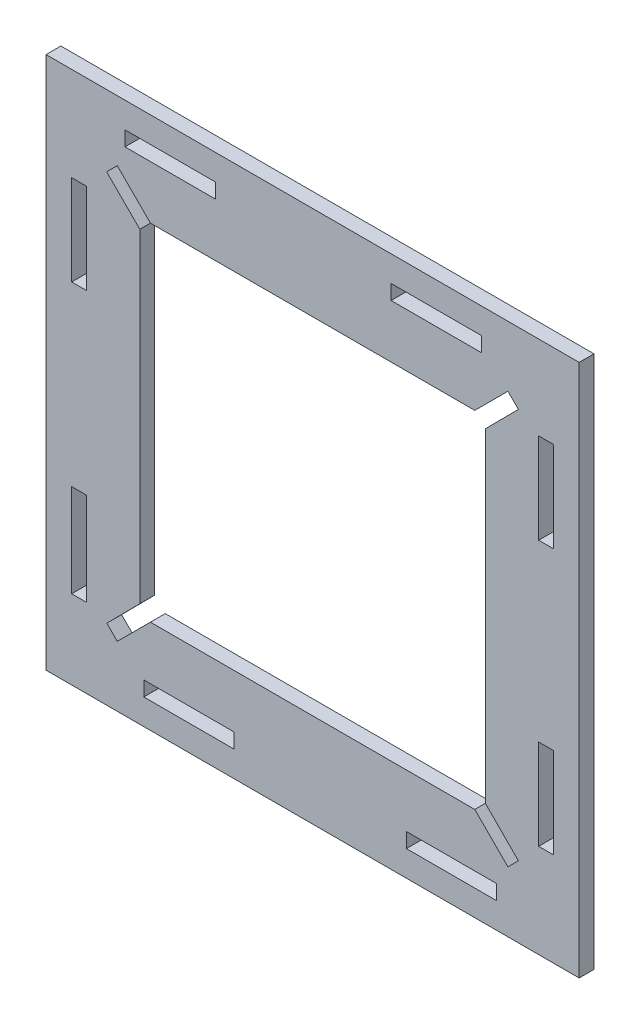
ISO-10303-21;
HEADER;
FILE_DESCRIPTION(('STEP AP214'),'2;1');
FILE_NAME('part.step','',(''),(''),'','','');
FILE_SCHEMA(('AUTOMOTIVE_DESIGN { 1 0 10303 214 1 1 1 1 }'));
ENDSEC;
DATA;
#1=APPLICATION_CONTEXT('core data for automotive mechanical design processes');
#2=APPLICATION_PROTOCOL_DEFINITION('international standard','automotive_design',2000,#1);
#3=PRODUCT_CONTEXT('',#1,'mechanical');
#4=PRODUCT('Part','Part','',(#3));
#5=PRODUCT_RELATED_PRODUCT_CATEGORY('part','',(#4));
#6=PRODUCT_DEFINITION_FORMATION('','',#4);
#7=PRODUCT_DEFINITION_CONTEXT('part definition',#1,'design');
#8=PRODUCT_DEFINITION('design','',#6,#7);
#9=PRODUCT_DEFINITION_SHAPE('','',#8);
#10=(LENGTH_UNIT() NAMED_UNIT(*) SI_UNIT(.MILLI.,.METRE.));
#11=(NAMED_UNIT(*) PLANE_ANGLE_UNIT() SI_UNIT($,.RADIAN.));
#12=(NAMED_UNIT(*) SI_UNIT($,.STERADIAN.) SOLID_ANGLE_UNIT());
#13=UNCERTAINTY_MEASURE_WITH_UNIT(LENGTH_MEASURE(1.E-05),#10,'distance_accuracy_value','');
#14=(GEOMETRIC_REPRESENTATION_CONTEXT(3) GLOBAL_UNCERTAINTY_ASSIGNED_CONTEXT((#13)) GLOBAL_UNIT_ASSIGNED_CONTEXT((#10,
#11,#12)) REPRESENTATION_CONTEXT('',''));
#15=CARTESIAN_POINT('',(0.,0.,0.));
#16=DIRECTION('',(0.,0.,1.));
#17=DIRECTION('',(1.,0.,0.));
#18=AXIS2_PLACEMENT_3D('',#15,#16,#17);
#19=CARTESIAN_POINT('',(0.,-16.7,3.));
#20=DIRECTION('',(0.,1.,0.));
#21=DIRECTION('',(-1.,0.,0.));
#22=AXIS2_PLACEMENT_3D('',#19,#20,#21);
#23=PLANE('',#22);
#24=DIRECTION('',(1.,0.,0.));
#25=VECTOR('',#24,1.);
#26=CARTESIAN_POINT('',(0.,-16.7,0.));
#27=LINE('',#26,#25);
#28=CARTESIAN_POINT('',(45.8,-16.7,0.));
#29=VERTEX_POINT('',#28);
#30=CARTESIAN_POINT('',(48.8,-16.7,0.));
#31=VERTEX_POINT('',#30);
#32=EDGE_CURVE('E594',#29,#31,#27,.T.);
#33=ORIENTED_EDGE('',*,*,#32,.T.);
#34=DIRECTION('',(0.,0.,-1.));
#35=VECTOR('',#34,1.);
#36=CARTESIAN_POINT('',(48.8,-16.7,3.));
#37=LINE('',#36,#35);
#38=CARTESIAN_POINT('',(48.8,-16.7,3.));
#39=VERTEX_POINT('',#38);
#40=EDGE_CURVE('E11',#39,#31,#37,.T.);
#41=ORIENTED_EDGE('',*,*,#40,.F.);
#42=DIRECTION('',(1.,0.,0.));
#43=VECTOR('',#42,1.);
#44=CARTESIAN_POINT('',(0.,-16.7,3.));
#45=LINE('',#44,#43);
#46=CARTESIAN_POINT('',(45.8,-16.7,3.));
#47=VERTEX_POINT('',#46);
#48=EDGE_CURVE('E389',#47,#39,#45,.T.);
#49=ORIENTED_EDGE('',*,*,#48,.F.);
#50=DIRECTION('',(0.,0.,-1.));
#51=VECTOR('',#50,1.);
#52=CARTESIAN_POINT('',(45.8,-16.7,3.));
#53=LINE('',#52,#51);
#54=EDGE_CURVE('E65',#47,#29,#53,.T.);
#55=ORIENTED_EDGE('',*,*,#54,.T.);
#56=EDGE_LOOP('',(#33,#41,#49,#55));
#57=FACE_BOUND('',#56,.T.);
#58=ADVANCED_FACE('F45',(#57),#23,.F.);
#59=CARTESIAN_POINT('',(48.8,0.,3.));
#60=DIRECTION('',(1.,0.,0.));
#61=DIRECTION('',(0.,1.,0.));
#62=AXIS2_PLACEMENT_3D('',#59,#60,#61);
#63=PLANE('',#62);
#64=DIRECTION('',(0.,-1.,0.));
#65=VECTOR('',#64,1.);
#66=CARTESIAN_POINT('',(48.8,0.,0.));
#67=LINE('',#66,#65);
#68=CARTESIAN_POINT('',(48.8,-35.,0.));
#69=VERTEX_POINT('',#68);
#70=EDGE_CURVE('E396',#31,#69,#67,.T.);
#71=ORIENTED_EDGE('',*,*,#70,.T.);
#72=DIRECTION('',(0.,0.,-1.));
#73=VECTOR('',#72,1.);
#74=CARTESIAN_POINT('',(48.8,-35.,3.));
#75=LINE('',#74,#73);
#76=CARTESIAN_POINT('',(48.8,-35.,3.));
#77=VERTEX_POINT('',#76);
#78=EDGE_CURVE('E56',#77,#69,#75,.T.);
#79=ORIENTED_EDGE('',*,*,#78,.F.);
#80=DIRECTION('',(0.,-1.,0.));
#81=VECTOR('',#80,1.);
#82=CARTESIAN_POINT('',(48.8,0.,3.));
#83=LINE('',#82,#81);
#84=EDGE_CURVE('E383',#39,#77,#83,.T.);
#85=ORIENTED_EDGE('',*,*,#84,.F.);
#86=ORIENTED_EDGE('',*,*,#40,.T.);
#87=EDGE_LOOP('',(#71,#79,#85,#86));
#88=FACE_BOUND('',#87,.T.);
#89=ADVANCED_FACE('F395',(#88),#63,.F.);
#90=CARTESIAN_POINT('',(0.,-35.,3.));
#91=DIRECTION('',(0.,1.,0.));
#92=DIRECTION('',(0.,0.,1.));
#93=AXIS2_PLACEMENT_3D('',#90,#91,#92);
#94=PLANE('',#93);
#95=DIRECTION('',(1.,0.,0.));
#96=VECTOR('',#95,1.);
#97=CARTESIAN_POINT('',(0.,-35.,0.));
#98=LINE('',#97,#96);
#99=CARTESIAN_POINT('',(45.8,-35.,0.));
#100=VERTEX_POINT('',#99);
#101=EDGE_CURVE('E599',#100,#69,#98,.T.);
#102=ORIENTED_EDGE('',*,*,#101,.F.);
#103=DIRECTION('',(0.,0.,-1.));
#104=VECTOR('',#103,1.);
#105=CARTESIAN_POINT('',(45.8,-35.,3.));
#106=LINE('',#105,#104);
#107=CARTESIAN_POINT('',(45.8,-35.,3.));
#108=VERTEX_POINT('',#107);
#109=EDGE_CURVE('E223',#108,#100,#106,.T.);
#110=ORIENTED_EDGE('',*,*,#109,.F.);
#111=DIRECTION('',(1.,0.,0.));
#112=VECTOR('',#111,1.);
#113=CARTESIAN_POINT('',(0.,-35.,3.));
#114=LINE('',#113,#112);
#115=EDGE_CURVE('E388',#108,#77,#114,.T.);
#116=ORIENTED_EDGE('',*,*,#115,.T.);
#117=ORIENTED_EDGE('',*,*,#78,.T.);
#118=EDGE_LOOP('',(#102,#110,#116,#117));
#119=FACE_BOUND('',#118,.T.);
#120=ADVANCED_FACE('F401',(#119),#94,.T.);
#121=CARTESIAN_POINT('',(0.,35.,3.));
#122=DIRECTION('',(0.,1.,0.));
#123=DIRECTION('',(0.,0.,1.));
#124=AXIS2_PLACEMENT_3D('',#121,#122,#123);
#125=PLANE('',#124);
#126=DIRECTION('',(1.,0.,0.));
#127=VECTOR('',#126,1.);
#128=CARTESIAN_POINT('',(0.,35.,0.));
#129=LINE('',#128,#127);
#130=CARTESIAN_POINT('',(-48.8,35.,0.));
#131=VERTEX_POINT('',#130);
#132=CARTESIAN_POINT('',(-45.8,35.,0.));
#133=VERTEX_POINT('',#132);
#134=EDGE_CURVE('E578',#131,#133,#129,.T.);
#135=ORIENTED_EDGE('',*,*,#134,.T.);
#136=DIRECTION('',(0.,0.,-1.));
#137=VECTOR('',#136,1.);
#138=CARTESIAN_POINT('',(-45.8,35.,3.));
#139=LINE('',#138,#137);
#140=CARTESIAN_POINT('',(-45.8,35.,3.));
#141=VERTEX_POINT('',#140);
#142=EDGE_CURVE('E609',#141,#133,#139,.T.);
#143=ORIENTED_EDGE('',*,*,#142,.F.);
#144=DIRECTION('',(1.,0.,0.));
#145=VECTOR('',#144,1.);
#146=CARTESIAN_POINT('',(0.,35.,3.));
#147=LINE('',#146,#145);
#148=CARTESIAN_POINT('',(-48.8,35.,3.));
#149=VERTEX_POINT('',#148);
#150=EDGE_CURVE('E941',#149,#141,#147,.T.);
#151=ORIENTED_EDGE('',*,*,#150,.F.);
#152=DIRECTION('',(0.,0.,-1.));
#153=VECTOR('',#152,1.);
#154=CARTESIAN_POINT('',(-48.8,35.,3.));
#155=LINE('',#154,#153);
#156=EDGE_CURVE('E612',#149,#131,#155,.T.);
#157=ORIENTED_EDGE('',*,*,#156,.T.);
#158=EDGE_LOOP('',(#135,#143,#151,#157));
#159=FACE_BOUND('',#158,.T.);
#160=ADVANCED_FACE('F972',(#159),#125,.F.);
#161=CARTESIAN_POINT('',(-45.8,0.,3.));
#162=DIRECTION('',(1.,0.,0.));
#163=DIRECTION('',(0.,0.,-1.));
#164=AXIS2_PLACEMENT_3D('',#161,#162,#163);
#165=PLANE('',#164);
#166=DIRECTION('',(0.,-1.,0.));
#167=VECTOR('',#166,1.);
#168=CARTESIAN_POINT('',(-45.8,0.,0.));
#169=LINE('',#168,#167);
#170=CARTESIAN_POINT('',(-45.8,16.7,0.));
#171=VERTEX_POINT('',#170);
#172=EDGE_CURVE('E582',#133,#171,#169,.T.);
#173=ORIENTED_EDGE('',*,*,#172,.T.);
#174=DIRECTION('',(0.,0.,-1.));
#175=VECTOR('',#174,1.);
#176=CARTESIAN_POINT('',(-45.8,16.7,3.));
#177=LINE('',#176,#175);
#178=CARTESIAN_POINT('',(-45.8,16.7,3.));
#179=VERTEX_POINT('',#178);
#180=EDGE_CURVE('E619',#179,#171,#177,.T.);
#181=ORIENTED_EDGE('',*,*,#180,.F.);
#182=DIRECTION('',(0.,-1.,0.));
#183=VECTOR('',#182,1.);
#184=CARTESIAN_POINT('',(-45.8,0.,3.));
#185=LINE('',#184,#183);
#186=EDGE_CURVE('E945',#141,#179,#185,.T.);
#187=ORIENTED_EDGE('',*,*,#186,.F.);
#188=ORIENTED_EDGE('',*,*,#142,.T.);
#189=EDGE_LOOP('',(#173,#181,#187,#188));
#190=FACE_BOUND('',#189,.T.);
#191=ADVANCED_FACE('F974',(#190),#165,.F.);
#192=CARTESIAN_POINT('',(0.,16.7,3.));
#193=DIRECTION('',(0.,1.,0.));
#194=DIRECTION('',(0.,0.,1.));
#195=AXIS2_PLACEMENT_3D('',#192,#193,#194);
#196=PLANE('',#195);
#197=DIRECTION('',(1.,0.,0.));
#198=VECTOR('',#197,1.);
#199=CARTESIAN_POINT('',(0.,16.7,0.));
#200=LINE('',#199,#198);
#201=CARTESIAN_POINT('',(-48.8,16.7,0.));
#202=VERTEX_POINT('',#201);
#203=EDGE_CURVE('E586',#202,#171,#200,.T.);
#204=ORIENTED_EDGE('',*,*,#203,.F.);
#205=DIRECTION('',(0.,0.,-1.));
#206=VECTOR('',#205,1.);
#207=CARTESIAN_POINT('',(-48.8,16.7,3.));
#208=LINE('',#207,#206);
#209=CARTESIAN_POINT('',(-48.8,16.7,3.));
#210=VERTEX_POINT('',#209);
#211=EDGE_CURVE('E615',#210,#202,#208,.T.);
#212=ORIENTED_EDGE('',*,*,#211,.F.);
#213=DIRECTION('',(1.,0.,0.));
#214=VECTOR('',#213,1.);
#215=CARTESIAN_POINT('',(0.,16.7,3.));
#216=LINE('',#215,#214);
#217=EDGE_CURVE('E948',#210,#179,#216,.T.);
#218=ORIENTED_EDGE('',*,*,#217,.T.);
#219=ORIENTED_EDGE('',*,*,#180,.T.);
#220=EDGE_LOOP('',(#204,#212,#218,#219));
#221=FACE_BOUND('',#220,.T.);
#222=ADVANCED_FACE('F967',(#221),#196,.T.);
#223=CARTESIAN_POINT('',(0.,-45.8,3.));
#224=DIRECTION('',(0.,1.,0.));
#225=DIRECTION('',(0.,0.,1.));
#226=AXIS2_PLACEMENT_3D('',#223,#224,#225);
#227=PLANE('',#226);
#228=DIRECTION('',(1.,0.,0.));
#229=VECTOR('',#228,1.);
#230=CARTESIAN_POINT('',(0.,-45.8,0.));
#231=LINE('',#230,#229);
#232=CARTESIAN_POINT('',(19.,-45.8,0.));
#233=VERTEX_POINT('',#232);
#234=CARTESIAN_POINT('',(37.3,-45.8,0.));
#235=VERTEX_POINT('',#234);
#236=EDGE_CURVE('E562',#233,#235,#231,.T.);
#237=ORIENTED_EDGE('',*,*,#236,.T.);
#238=DIRECTION('',(0.,0.,-1.));
#239=VECTOR('',#238,1.);
#240=CARTESIAN_POINT('',(37.3,-45.8,3.));
#241=LINE('',#240,#239);
#242=CARTESIAN_POINT('',(37.3,-45.8,3.));
#243=VERTEX_POINT('',#242);
#244=EDGE_CURVE('E616',#243,#235,#241,.T.);
#245=ORIENTED_EDGE('',*,*,#244,.F.);
#246=DIRECTION('',(1.,0.,0.));
#247=VECTOR('',#246,1.);
#248=CARTESIAN_POINT('',(0.,-45.8,3.));
#249=LINE('',#248,#247);
#250=CARTESIAN_POINT('',(19.,-45.8,3.));
#251=VERTEX_POINT('',#250);
#252=EDGE_CURVE('E926',#251,#243,#249,.T.);
#253=ORIENTED_EDGE('',*,*,#252,.F.);
#254=DIRECTION('',(0.,0.,-1.));
#255=VECTOR('',#254,1.);
#256=CARTESIAN_POINT('',(19.,-45.8,3.));
#257=LINE('',#256,#255);
#258=EDGE_CURVE('E625',#251,#233,#257,.T.);
#259=ORIENTED_EDGE('',*,*,#258,.T.);
#260=EDGE_LOOP('',(#237,#245,#253,#259));
#261=FACE_BOUND('',#260,.T.);
#262=ADVANCED_FACE('F981',(#261),#227,.F.);
#263=CARTESIAN_POINT('',(37.3,0.,3.));
#264=DIRECTION('',(1.,0.,0.));
#265=DIRECTION('',(0.,0.,-1.));
#266=AXIS2_PLACEMENT_3D('',#263,#264,#265);
#267=PLANE('',#266);
#268=DIRECTION('',(0.,-1.,0.));
#269=VECTOR('',#268,1.);
#270=CARTESIAN_POINT('',(37.3,0.,0.));
#271=LINE('',#270,#269);
#272=CARTESIAN_POINT('',(37.3,-48.8,0.));
#273=VERTEX_POINT('',#272);
#274=EDGE_CURVE('E566',#235,#273,#271,.T.);
#275=ORIENTED_EDGE('',*,*,#274,.T.);
#276=DIRECTION('',(0.,0.,-1.));
#277=VECTOR('',#276,1.);
#278=CARTESIAN_POINT('',(37.3,-48.8,3.));
#279=LINE('',#278,#277);
#280=CARTESIAN_POINT('',(37.3,-48.8,3.));
#281=VERTEX_POINT('',#280);
#282=EDGE_CURVE('E632',#281,#273,#279,.T.);
#283=ORIENTED_EDGE('',*,*,#282,.F.);
#284=DIRECTION('',(0.,-1.,0.));
#285=VECTOR('',#284,1.);
#286=CARTESIAN_POINT('',(37.3,0.,3.));
#287=LINE('',#286,#285);
#288=EDGE_CURVE('E930',#243,#281,#287,.T.);
#289=ORIENTED_EDGE('',*,*,#288,.F.);
#290=ORIENTED_EDGE('',*,*,#244,.T.);
#291=EDGE_LOOP('',(#275,#283,#289,#290));
#292=FACE_BOUND('',#291,.T.);
#293=ADVANCED_FACE('F1162',(#292),#267,.F.);
#294=CARTESIAN_POINT('',(0.,-48.8,3.));
#295=DIRECTION('',(0.,1.,0.));
#296=DIRECTION('',(-1.,0.,0.));
#297=AXIS2_PLACEMENT_3D('',#294,#295,#296);
#298=PLANE('',#297);
#299=DIRECTION('',(1.,0.,0.));
#300=VECTOR('',#299,1.);
#301=CARTESIAN_POINT('',(0.,-48.8,0.));
#302=LINE('',#301,#300);
#303=CARTESIAN_POINT('',(19.,-48.8,0.));
#304=VERTEX_POINT('',#303);
#305=EDGE_CURVE('E570',#304,#273,#302,.T.);
#306=ORIENTED_EDGE('',*,*,#305,.F.);
#307=DIRECTION('',(0.,0.,-1.));
#308=VECTOR('',#307,1.);
#309=CARTESIAN_POINT('',(19.,-48.8,3.));
#310=LINE('',#309,#308);
#311=CARTESIAN_POINT('',(19.,-48.8,3.));
#312=VERTEX_POINT('',#311);
#313=EDGE_CURVE('E628',#312,#304,#310,.T.);
#314=ORIENTED_EDGE('',*,*,#313,.F.);
#315=DIRECTION('',(1.,0.,0.));
#316=VECTOR('',#315,1.);
#317=CARTESIAN_POINT('',(0.,-48.8,3.));
#318=LINE('',#317,#316);
#319=EDGE_CURVE('E933',#312,#281,#318,.T.);
#320=ORIENTED_EDGE('',*,*,#319,.T.);
#321=ORIENTED_EDGE('',*,*,#282,.T.);
#322=EDGE_LOOP('',(#306,#314,#320,#321));
#323=FACE_BOUND('',#322,.T.);
#324=ADVANCED_FACE('F1165',(#323),#298,.T.);
#325=CARTESIAN_POINT('',(0.,-45.8,3.));
#326=DIRECTION('',(0.,1.,0.));
#327=DIRECTION('',(0.,0.,1.));
#328=AXIS2_PLACEMENT_3D('',#325,#326,#327);
#329=PLANE('',#328);
#330=DIRECTION('',(1.,0.,0.));
#331=VECTOR('',#330,1.);
#332=CARTESIAN_POINT('',(0.,-45.8,0.));
#333=LINE('',#332,#331);
#334=CARTESIAN_POINT('',(-34.2,-45.8,0.));
#335=VERTEX_POINT('',#334);
#336=CARTESIAN_POINT('',(-15.9,-45.8,0.));
#337=VERTEX_POINT('',#336);
#338=EDGE_CURVE('E546',#335,#337,#333,.T.);
#339=ORIENTED_EDGE('',*,*,#338,.T.);
#340=DIRECTION('',(0.,0.,-1.));
#341=VECTOR('',#340,1.);
#342=CARTESIAN_POINT('',(-15.9,-45.8,3.));
#343=LINE('',#342,#341);
#344=CARTESIAN_POINT('',(-15.9,-45.8,3.));
#345=VERTEX_POINT('',#344);
#346=EDGE_CURVE('E629',#345,#337,#343,.T.);
#347=ORIENTED_EDGE('',*,*,#346,.F.);
#348=DIRECTION('',(1.,0.,0.));
#349=VECTOR('',#348,1.);
#350=CARTESIAN_POINT('',(0.,-45.8,3.));
#351=LINE('',#350,#349);
#352=CARTESIAN_POINT('',(-34.2,-45.8,3.));
#353=VERTEX_POINT('',#352);
#354=EDGE_CURVE('E911',#353,#345,#351,.T.);
#355=ORIENTED_EDGE('',*,*,#354,.F.);
#356=DIRECTION('',(0.,0.,-1.));
#357=VECTOR('',#356,1.);
#358=CARTESIAN_POINT('',(-34.2,-45.8,3.));
#359=LINE('',#358,#357);
#360=EDGE_CURVE('E638',#353,#335,#359,.T.);
#361=ORIENTED_EDGE('',*,*,#360,.T.);
#362=EDGE_LOOP('',(#339,#347,#355,#361));
#363=FACE_BOUND('',#362,.T.);
#364=ADVANCED_FACE('F1223',(#363),#329,.F.);
#365=CARTESIAN_POINT('',(-15.9,0.,3.));
#366=DIRECTION('',(1.,0.,0.));
#367=DIRECTION('',(0.,0.,-1.));
#368=AXIS2_PLACEMENT_3D('',#365,#366,#367);
#369=PLANE('',#368);
#370=DIRECTION('',(0.,-1.,0.));
#371=VECTOR('',#370,1.);
#372=CARTESIAN_POINT('',(-15.9,0.,0.));
#373=LINE('',#372,#371);
#374=CARTESIAN_POINT('',(-15.9,-48.8,0.));
#375=VERTEX_POINT('',#374);
#376=EDGE_CURVE('E550',#337,#375,#373,.T.);
#377=ORIENTED_EDGE('',*,*,#376,.T.);
#378=DIRECTION('',(0.,0.,-1.));
#379=VECTOR('',#378,1.);
#380=CARTESIAN_POINT('',(-15.9,-48.8,3.));
#381=LINE('',#380,#379);
#382=CARTESIAN_POINT('',(-15.9,-48.8,3.));
#383=VERTEX_POINT('',#382);
#384=EDGE_CURVE('E645',#383,#375,#381,.T.);
#385=ORIENTED_EDGE('',*,*,#384,.F.);
#386=DIRECTION('',(0.,-1.,0.));
#387=VECTOR('',#386,1.);
#388=CARTESIAN_POINT('',(-15.9,0.,3.));
#389=LINE('',#388,#387);
#390=EDGE_CURVE('E915',#345,#383,#389,.T.);
#391=ORIENTED_EDGE('',*,*,#390,.F.);
#392=ORIENTED_EDGE('',*,*,#346,.T.);
#393=EDGE_LOOP('',(#377,#385,#391,#392));
#394=FACE_BOUND('',#393,.T.);
#395=ADVANCED_FACE('F1233',(#394),#369,.F.);
#396=CARTESIAN_POINT('',(0.,-48.8,3.));
#397=DIRECTION('',(0.,1.,0.));
#398=DIRECTION('',(0.,0.,1.));
#399=AXIS2_PLACEMENT_3D('',#396,#397,#398);
#400=PLANE('',#399);
#401=DIRECTION('',(1.,0.,0.));
#402=VECTOR('',#401,1.);
#403=CARTESIAN_POINT('',(0.,-48.8,0.));
#404=LINE('',#403,#402);
#405=CARTESIAN_POINT('',(-34.2,-48.8,0.));
#406=VERTEX_POINT('',#405);
#407=EDGE_CURVE('E554',#406,#375,#404,.T.);
#408=ORIENTED_EDGE('',*,*,#407,.F.);
#409=DIRECTION('',(0.,0.,-1.));
#410=VECTOR('',#409,1.);
#411=CARTESIAN_POINT('',(-34.2,-48.8,3.));
#412=LINE('',#411,#410);
#413=CARTESIAN_POINT('',(-34.2,-48.8,3.));
#414=VERTEX_POINT('',#413);
#415=EDGE_CURVE('E641',#414,#406,#412,.T.);
#416=ORIENTED_EDGE('',*,*,#415,.F.);
#417=DIRECTION('',(1.,0.,0.));
#418=VECTOR('',#417,1.);
#419=CARTESIAN_POINT('',(0.,-48.8,3.));
#420=LINE('',#419,#418);
#421=EDGE_CURVE('E918',#414,#383,#420,.T.);
#422=ORIENTED_EDGE('',*,*,#421,.T.);
#423=ORIENTED_EDGE('',*,*,#384,.T.);
#424=EDGE_LOOP('',(#408,#416,#422,#423));
#425=FACE_BOUND('',#424,.T.);
#426=ADVANCED_FACE('F1244',(#425),#400,.T.);
#427=CARTESIAN_POINT('',(0.,48.8,3.));
#428=DIRECTION('',(0.,1.,0.));
#429=DIRECTION('',(-1.,0.,0.));
#430=AXIS2_PLACEMENT_3D('',#427,#428,#429);
#431=PLANE('',#430);
#432=DIRECTION('',(1.,0.,0.));
#433=VECTOR('',#432,1.);
#434=CARTESIAN_POINT('',(0.,48.8,0.));
#435=LINE('',#434,#433);
#436=CARTESIAN_POINT('',(-38.,48.8,0.));
#437=VERTEX_POINT('',#436);
#438=CARTESIAN_POINT('',(-19.7,48.8,0.));
#439=VERTEX_POINT('',#438);
#440=EDGE_CURVE('E530',#437,#439,#435,.T.);
#441=ORIENTED_EDGE('',*,*,#440,.T.);
#442=DIRECTION('',(0.,0.,-1.));
#443=VECTOR('',#442,1.);
#444=CARTESIAN_POINT('',(-19.7,48.8,3.));
#445=LINE('',#444,#443);
#446=CARTESIAN_POINT('',(-19.7,48.8,3.));
#447=VERTEX_POINT('',#446);
#448=EDGE_CURVE('E642',#447,#439,#445,.T.);
#449=ORIENTED_EDGE('',*,*,#448,.F.);
#450=DIRECTION('',(1.,0.,0.));
#451=VECTOR('',#450,1.);
#452=CARTESIAN_POINT('',(0.,48.8,3.));
#453=LINE('',#452,#451);
#454=CARTESIAN_POINT('',(-38.,48.8,3.));
#455=VERTEX_POINT('',#454);
#456=EDGE_CURVE('E896',#455,#447,#453,.T.);
#457=ORIENTED_EDGE('',*,*,#456,.F.);
#458=DIRECTION('',(0.,0.,-1.));
#459=VECTOR('',#458,1.);
#460=CARTESIAN_POINT('',(-38.,48.8,3.));
#461=LINE('',#460,#459);
#462=EDGE_CURVE('E651',#455,#437,#461,.T.);
#463=ORIENTED_EDGE('',*,*,#462,.T.);
#464=EDGE_LOOP('',(#441,#449,#457,#463));
#465=FACE_BOUND('',#464,.T.);
#466=ADVANCED_FACE('F1255',(#465),#431,.F.);
#467=CARTESIAN_POINT('',(-19.7,0.,3.));
#468=DIRECTION('',(1.,0.,0.));
#469=DIRECTION('',(0.,0.,-1.));
#470=AXIS2_PLACEMENT_3D('',#467,#468,#469);
#471=PLANE('',#470);
#472=DIRECTION('',(0.,-1.,0.));
#473=VECTOR('',#472,1.);
#474=CARTESIAN_POINT('',(-19.7,0.,0.));
#475=LINE('',#474,#473);
#476=CARTESIAN_POINT('',(-19.7,45.8,0.));
#477=VERTEX_POINT('',#476);
#478=EDGE_CURVE('E534',#439,#477,#475,.T.);
#479=ORIENTED_EDGE('',*,*,#478,.T.);
#480=DIRECTION('',(0.,0.,-1.));
#481=VECTOR('',#480,1.);
#482=CARTESIAN_POINT('',(-19.7,45.8,3.));
#483=LINE('',#482,#481);
#484=CARTESIAN_POINT('',(-19.7,45.8,3.));
#485=VERTEX_POINT('',#484);
#486=EDGE_CURVE('E658',#485,#477,#483,.T.);
#487=ORIENTED_EDGE('',*,*,#486,.F.);
#488=DIRECTION('',(0.,-1.,0.));
#489=VECTOR('',#488,1.);
#490=CARTESIAN_POINT('',(-19.7,0.,3.));
#491=LINE('',#490,#489);
#492=EDGE_CURVE('E900',#447,#485,#491,.T.);
#493=ORIENTED_EDGE('',*,*,#492,.F.);
#494=ORIENTED_EDGE('',*,*,#448,.T.);
#495=EDGE_LOOP('',(#479,#487,#493,#494));
#496=FACE_BOUND('',#495,.T.);
#497=ADVANCED_FACE('F1266',(#496),#471,.F.);
#498=CARTESIAN_POINT('',(0.,45.8,3.));
#499=DIRECTION('',(0.,1.,0.));
#500=DIRECTION('',(0.,0.,1.));
#501=AXIS2_PLACEMENT_3D('',#498,#499,#500);
#502=PLANE('',#501);
#503=DIRECTION('',(1.,0.,0.));
#504=VECTOR('',#503,1.);
#505=CARTESIAN_POINT('',(0.,45.8,0.));
#506=LINE('',#505,#504);
#507=CARTESIAN_POINT('',(-38.,45.8,0.));
#508=VERTEX_POINT('',#507);
#509=EDGE_CURVE('E538',#508,#477,#506,.T.);
#510=ORIENTED_EDGE('',*,*,#509,.F.);
#511=DIRECTION('',(0.,0.,-1.));
#512=VECTOR('',#511,1.);
#513=CARTESIAN_POINT('',(-38.,45.8,3.));
#514=LINE('',#513,#512);
#515=CARTESIAN_POINT('',(-38.,45.8,3.));
#516=VERTEX_POINT('',#515);
#517=EDGE_CURVE('E654',#516,#508,#514,.T.);
#518=ORIENTED_EDGE('',*,*,#517,.F.);
#519=DIRECTION('',(1.,0.,0.));
#520=VECTOR('',#519,1.);
#521=CARTESIAN_POINT('',(0.,45.8,3.));
#522=LINE('',#521,#520);
#523=EDGE_CURVE('E903',#516,#485,#522,.T.);
#524=ORIENTED_EDGE('',*,*,#523,.T.);
#525=ORIENTED_EDGE('',*,*,#486,.T.);
#526=EDGE_LOOP('',(#510,#518,#524,#525));
#527=FACE_BOUND('',#526,.T.);
#528=ADVANCED_FACE('F1277',(#527),#502,.T.);
#529=CARTESIAN_POINT('',(0.,48.8,3.));
#530=DIRECTION('',(0.,1.,0.));
#531=DIRECTION('',(0.,0.,1.));
#532=AXIS2_PLACEMENT_3D('',#529,#530,#531);
#533=PLANE('',#532);
#534=DIRECTION('',(1.,0.,0.));
#535=VECTOR('',#534,1.);
#536=CARTESIAN_POINT('',(0.,48.8,0.));
#537=LINE('',#536,#535);
#538=CARTESIAN_POINT('',(15.9,48.8,0.));
#539=VERTEX_POINT('',#538);
#540=CARTESIAN_POINT('',(34.2,48.8,0.));
#541=VERTEX_POINT('',#540);
#542=EDGE_CURVE('E514',#539,#541,#537,.T.);
#543=ORIENTED_EDGE('',*,*,#542,.T.);
#544=DIRECTION('',(0.,0.,-1.));
#545=VECTOR('',#544,1.);
#546=CARTESIAN_POINT('',(34.2,48.8,3.));
#547=LINE('',#546,#545);
#548=CARTESIAN_POINT('',(34.2,48.8,3.));
#549=VERTEX_POINT('',#548);
#550=EDGE_CURVE('E655',#549,#541,#547,.T.);
#551=ORIENTED_EDGE('',*,*,#550,.F.);
#552=DIRECTION('',(1.,0.,0.));
#553=VECTOR('',#552,1.);
#554=CARTESIAN_POINT('',(0.,48.8,3.));
#555=LINE('',#554,#553);
#556=CARTESIAN_POINT('',(15.9,48.8,3.));
#557=VERTEX_POINT('',#556);
#558=EDGE_CURVE('E881',#557,#549,#555,.T.);
#559=ORIENTED_EDGE('',*,*,#558,.F.);
#560=DIRECTION('',(0.,0.,-1.));
#561=VECTOR('',#560,1.);
#562=CARTESIAN_POINT('',(15.9,48.8,3.));
#563=LINE('',#562,#561);
#564=EDGE_CURVE('E664',#557,#539,#563,.T.);
#565=ORIENTED_EDGE('',*,*,#564,.T.);
#566=EDGE_LOOP('',(#543,#551,#559,#565));
#567=FACE_BOUND('',#566,.T.);
#568=ADVANCED_FACE('F1288',(#567),#533,.F.);
#569=CARTESIAN_POINT('',(34.2,0.,3.));
#570=DIRECTION('',(1.,0.,0.));
#571=DIRECTION('',(0.,0.,-1.));
#572=AXIS2_PLACEMENT_3D('',#569,#570,#571);
#573=PLANE('',#572);
#574=DIRECTION('',(0.,-1.,0.));
#575=VECTOR('',#574,1.);
#576=CARTESIAN_POINT('',(34.2,0.,0.));
#577=LINE('',#576,#575);
#578=CARTESIAN_POINT('',(34.2,45.8,0.));
#579=VERTEX_POINT('',#578);
#580=EDGE_CURVE('E518',#541,#579,#577,.T.);
#581=ORIENTED_EDGE('',*,*,#580,.T.);
#582=DIRECTION('',(0.,0.,-1.));
#583=VECTOR('',#582,1.);
#584=CARTESIAN_POINT('',(34.2,45.8,3.));
#585=LINE('',#584,#583);
#586=CARTESIAN_POINT('',(34.2,45.8,3.));
#587=VERTEX_POINT('',#586);
#588=EDGE_CURVE('E671',#587,#579,#585,.T.);
#589=ORIENTED_EDGE('',*,*,#588,.F.);
#590=DIRECTION('',(0.,-1.,0.));
#591=VECTOR('',#590,1.);
#592=CARTESIAN_POINT('',(34.2,0.,3.));
#593=LINE('',#592,#591);
#594=EDGE_CURVE('E885',#549,#587,#593,.T.);
#595=ORIENTED_EDGE('',*,*,#594,.F.);
#596=ORIENTED_EDGE('',*,*,#550,.T.);
#597=EDGE_LOOP('',(#581,#589,#595,#596));
#598=FACE_BOUND('',#597,.T.);
#599=ADVANCED_FACE('F1299',(#598),#573,.F.);
#600=CARTESIAN_POINT('',(0.,45.8,3.));
#601=DIRECTION('',(0.,1.,0.));
#602=DIRECTION('',(0.,0.,1.));
#603=AXIS2_PLACEMENT_3D('',#600,#601,#602);
#604=PLANE('',#603);
#605=DIRECTION('',(1.,0.,0.));
#606=VECTOR('',#605,1.);
#607=CARTESIAN_POINT('',(0.,45.8,0.));
#608=LINE('',#607,#606);
#609=CARTESIAN_POINT('',(15.9,45.8,0.));
#610=VERTEX_POINT('',#609);
#611=EDGE_CURVE('E522',#610,#579,#608,.T.);
#612=ORIENTED_EDGE('',*,*,#611,.F.);
#613=DIRECTION('',(0.,0.,-1.));
#614=VECTOR('',#613,1.);
#615=CARTESIAN_POINT('',(15.9,45.8,3.));
#616=LINE('',#615,#614);
#617=CARTESIAN_POINT('',(15.9,45.8,3.));
#618=VERTEX_POINT('',#617);
#619=EDGE_CURVE('E667',#618,#610,#616,.T.);
#620=ORIENTED_EDGE('',*,*,#619,.F.);
#621=DIRECTION('',(1.,0.,0.));
#622=VECTOR('',#621,1.);
#623=CARTESIAN_POINT('',(0.,45.8,3.));
#624=LINE('',#623,#622);
#625=EDGE_CURVE('E888',#618,#587,#624,.T.);
#626=ORIENTED_EDGE('',*,*,#625,.T.);
#627=ORIENTED_EDGE('',*,*,#588,.T.);
#628=EDGE_LOOP('',(#612,#620,#626,#627));
#629=FACE_BOUND('',#628,.T.);
#630=ADVANCED_FACE('F1310',(#629),#604,.T.);
#631=CARTESIAN_POINT('',(0.,-54.,3.));
#632=DIRECTION('',(0.,1.,0.));
#633=DIRECTION('',(0.,0.,1.));
#634=AXIS2_PLACEMENT_3D('',#631,#632,#633);
#635=PLANE('',#634);
#636=DIRECTION('',(1.,0.,0.));
#637=VECTOR('',#636,1.);
#638=CARTESIAN_POINT('',(0.,-54.,0.));
#639=LINE('',#638,#637);
#640=CARTESIAN_POINT('',(-54.,-54.,0.));
#641=VERTEX_POINT('',#640);
#642=CARTESIAN_POINT('',(54.,-54.,0.));
#643=VERTEX_POINT('',#642);
#644=EDGE_CURVE('E498',#641,#643,#639,.T.);
#645=ORIENTED_EDGE('',*,*,#644,.T.);
#646=DIRECTION('',(0.,0.,-1.));
#647=VECTOR('',#646,1.);
#648=CARTESIAN_POINT('',(54.,-54.,3.));
#649=LINE('',#648,#647);
#650=CARTESIAN_POINT('',(54.,-54.,3.));
#651=VERTEX_POINT('',#650);
#652=EDGE_CURVE('E668',#651,#643,#649,.T.);
#653=ORIENTED_EDGE('',*,*,#652,.F.);
#654=DIRECTION('',(1.,0.,0.));
#655=VECTOR('',#654,1.);
#656=CARTESIAN_POINT('',(0.,-54.,3.));
#657=LINE('',#656,#655);
#658=CARTESIAN_POINT('',(-54.,-54.,3.));
#659=VERTEX_POINT('',#658);
#660=EDGE_CURVE('E866',#659,#651,#657,.T.);
#661=ORIENTED_EDGE('',*,*,#660,.F.);
#662=DIRECTION('',(0.,0.,-1.));
#663=VECTOR('',#662,1.);
#664=CARTESIAN_POINT('',(-54.,-54.,3.));
#665=LINE('',#664,#663);
#666=EDGE_CURVE('E677',#659,#641,#665,.T.);
#667=ORIENTED_EDGE('',*,*,#666,.T.);
#668=EDGE_LOOP('',(#645,#653,#661,#667));
#669=FACE_BOUND('',#668,.T.);
#670=ADVANCED_FACE('F1111',(#669),#635,.F.);
#671=CARTESIAN_POINT('',(54.,0.,3.));
#672=DIRECTION('',(-1.,0.,0.));
#673=DIRECTION('',(0.,0.,1.));
#674=AXIS2_PLACEMENT_3D('',#671,#672,#673);
#675=PLANE('',#674);
#676=DIRECTION('',(0.,1.,0.));
#677=VECTOR('',#676,1.);
#678=CARTESIAN_POINT('',(54.,0.,0.));
#679=LINE('',#678,#677);
#680=CARTESIAN_POINT('',(54.,54.,0.));
#681=VERTEX_POINT('',#680);
#682=EDGE_CURVE('E502',#643,#681,#679,.T.);
#683=ORIENTED_EDGE('',*,*,#682,.T.);
#684=DIRECTION('',(0.,0.,-1.));
#685=VECTOR('',#684,1.);
#686=CARTESIAN_POINT('',(54.,54.,3.));
#687=LINE('',#686,#685);
#688=CARTESIAN_POINT('',(54.,54.,3.));
#689=VERTEX_POINT('',#688);
#690=EDGE_CURVE('E684',#689,#681,#687,.T.);
#691=ORIENTED_EDGE('',*,*,#690,.F.);
#692=DIRECTION('',(0.,1.,0.));
#693=VECTOR('',#692,1.);
#694=CARTESIAN_POINT('',(54.,0.,3.));
#695=LINE('',#694,#693);
#696=EDGE_CURVE('E870',#651,#689,#695,.T.);
#697=ORIENTED_EDGE('',*,*,#696,.F.);
#698=ORIENTED_EDGE('',*,*,#652,.T.);
#699=EDGE_LOOP('',(#683,#691,#697,#698));
#700=FACE_BOUND('',#699,.T.);
#701=ADVANCED_FACE('F1123',(#700),#675,.F.);
#702=CARTESIAN_POINT('',(0.,54.,3.));
#703=DIRECTION('',(0.,1.,0.));
#704=DIRECTION('',(0.,0.,1.));
#705=AXIS2_PLACEMENT_3D('',#702,#703,#704);
#706=PLANE('',#705);
#707=DIRECTION('',(1.,0.,0.));
#708=VECTOR('',#707,1.);
#709=CARTESIAN_POINT('',(0.,54.,0.));
#710=LINE('',#709,#708);
#711=CARTESIAN_POINT('',(-54.,54.,0.));
#712=VERTEX_POINT('',#711);
#713=EDGE_CURVE('E506',#712,#681,#710,.T.);
#714=ORIENTED_EDGE('',*,*,#713,.F.);
#715=DIRECTION('',(0.,0.,-1.));
#716=VECTOR('',#715,1.);
#717=CARTESIAN_POINT('',(-54.,54.,3.));
#718=LINE('',#717,#716);
#719=CARTESIAN_POINT('',(-54.,54.,3.));
#720=VERTEX_POINT('',#719);
#721=EDGE_CURVE('E680',#720,#712,#718,.T.);
#722=ORIENTED_EDGE('',*,*,#721,.F.);
#723=DIRECTION('',(1.,0.,0.));
#724=VECTOR('',#723,1.);
#725=CARTESIAN_POINT('',(0.,54.,3.));
#726=LINE('',#725,#724);
#727=EDGE_CURVE('E873',#720,#689,#726,.T.);
#728=ORIENTED_EDGE('',*,*,#727,.T.);
#729=ORIENTED_EDGE('',*,*,#690,.T.);
#730=EDGE_LOOP('',(#714,#722,#728,#729));
#731=FACE_BOUND('',#730,.T.);
#732=ADVANCED_FACE('F1118',(#731),#706,.T.);
#733=CARTESIAN_POINT('',(-45.8,0.,3.));
#734=DIRECTION('',(-1.,0.,0.));
#735=DIRECTION('',(0.,0.,1.));
#736=AXIS2_PLACEMENT_3D('',#733,#734,#735);
#737=PLANE('',#736);
#738=DIRECTION('',(0.,1.,0.));
#739=VECTOR('',#738,1.);
#740=CARTESIAN_POINT('',(-45.8,0.,0.));
#741=LINE('',#740,#739);
#742=CARTESIAN_POINT('',(-45.8,-38.,0.));
#743=VERTEX_POINT('',#742);
#744=CARTESIAN_POINT('',(-45.8,-19.2,0.));
#745=VERTEX_POINT('',#744);
#746=EDGE_CURVE('E482',#743,#745,#741,.T.);
#747=ORIENTED_EDGE('',*,*,#746,.F.);
#748=DIRECTION('',(0.,0.,-1.));
#749=VECTOR('',#748,1.);
#750=CARTESIAN_POINT('',(-45.8,-38.,3.));
#751=LINE('',#750,#749);
#752=CARTESIAN_POINT('',(-45.8,-38.,3.));
#753=VERTEX_POINT('',#752);
#754=EDGE_CURVE('E681',#753,#743,#751,.T.);
#755=ORIENTED_EDGE('',*,*,#754,.F.);
#756=DIRECTION('',(0.,1.,0.));
#757=VECTOR('',#756,1.);
#758=CARTESIAN_POINT('',(-45.8,0.,3.));
#759=LINE('',#758,#757);
#760=CARTESIAN_POINT('',(-45.8,-19.2,3.));
#761=VERTEX_POINT('',#760);
#762=EDGE_CURVE('E851',#753,#761,#759,.T.);
#763=ORIENTED_EDGE('',*,*,#762,.T.);
#764=DIRECTION('',(0.,0.,-1.));
#765=VECTOR('',#764,1.);
#766=CARTESIAN_POINT('',(-45.8,-19.2,3.));
#767=LINE('',#766,#765);
#768=EDGE_CURVE('E690',#761,#745,#767,.T.);
#769=ORIENTED_EDGE('',*,*,#768,.T.);
#770=EDGE_LOOP('',(#747,#755,#763,#769));
#771=FACE_BOUND('',#770,.T.);
#772=ADVANCED_FACE('F1115',(#771),#737,.T.);
#773=CARTESIAN_POINT('',(0.,-38.,3.));
#774=DIRECTION('',(0.,1.,0.));
#775=DIRECTION('',(0.,0.,1.));
#776=AXIS2_PLACEMENT_3D('',#773,#774,#775);
#777=PLANE('',#776);
#778=DIRECTION('',(1.,0.,0.));
#779=VECTOR('',#778,1.);
#780=CARTESIAN_POINT('',(0.,-38.,0.));
#781=LINE('',#780,#779);
#782=CARTESIAN_POINT('',(-48.8,-38.,0.));
#783=VERTEX_POINT('',#782);
#784=EDGE_CURVE('E486',#783,#743,#781,.T.);
#785=ORIENTED_EDGE('',*,*,#784,.F.);
#786=DIRECTION('',(0.,0.,-1.));
#787=VECTOR('',#786,1.);
#788=CARTESIAN_POINT('',(-48.8,-38.,3.));
#789=LINE('',#788,#787);
#790=CARTESIAN_POINT('',(-48.8,-38.,3.));
#791=VERTEX_POINT('',#790);
#792=EDGE_CURVE('E698',#791,#783,#789,.T.);
#793=ORIENTED_EDGE('',*,*,#792,.F.);
#794=DIRECTION('',(1.,0.,0.));
#795=VECTOR('',#794,1.);
#796=CARTESIAN_POINT('',(0.,-38.,3.));
#797=LINE('',#796,#795);
#798=EDGE_CURVE('E855',#791,#753,#797,.T.);
#799=ORIENTED_EDGE('',*,*,#798,.T.);
#800=ORIENTED_EDGE('',*,*,#754,.T.);
#801=EDGE_LOOP('',(#785,#793,#799,#800));
#802=FACE_BOUND('',#801,.T.);
#803=ADVANCED_FACE('F1079',(#802),#777,.T.);
#804=CARTESIAN_POINT('',(-48.8,0.,3.));
#805=DIRECTION('',(-1.,0.,0.));
#806=DIRECTION('',(0.,0.,1.));
#807=AXIS2_PLACEMENT_3D('',#804,#805,#806);
#808=PLANE('',#807);
#809=DIRECTION('',(0.,1.,0.));
#810=VECTOR('',#809,1.);
#811=CARTESIAN_POINT('',(-48.8,0.,0.));
#812=LINE('',#811,#810);
#813=CARTESIAN_POINT('',(-48.8,-19.2,0.));
#814=VERTEX_POINT('',#813);
#815=EDGE_CURVE('E490',#783,#814,#812,.T.);
#816=ORIENTED_EDGE('',*,*,#815,.T.);
#817=DIRECTION('',(0.,0.,-1.));
#818=VECTOR('',#817,1.);
#819=CARTESIAN_POINT('',(-48.8,-19.2,3.));
#820=LINE('',#819,#818);
#821=CARTESIAN_POINT('',(-48.8,-19.2,3.));
#822=VERTEX_POINT('',#821);
#823=EDGE_CURVE('E693',#822,#814,#820,.T.);
#824=ORIENTED_EDGE('',*,*,#823,.F.);
#825=DIRECTION('',(0.,1.,0.));
#826=VECTOR('',#825,1.);
#827=CARTESIAN_POINT('',(-48.8,0.,3.));
#828=LINE('',#827,#826);
#829=EDGE_CURVE('E859',#791,#822,#828,.T.);
#830=ORIENTED_EDGE('',*,*,#829,.F.);
#831=ORIENTED_EDGE('',*,*,#792,.T.);
#832=EDGE_LOOP('',(#816,#824,#830,#831));
#833=FACE_BOUND('',#832,.T.);
#834=ADVANCED_FACE('F1074',(#833),#808,.F.);
#835=CARTESIAN_POINT('',(48.8,0.,3.));
#836=DIRECTION('',(-1.,0.,0.));
#837=DIRECTION('',(0.,-1.,0.));
#838=AXIS2_PLACEMENT_3D('',#835,#836,#837);
#839=PLANE('',#838);
#840=DIRECTION('',(0.,1.,0.));
#841=VECTOR('',#840,1.);
#842=CARTESIAN_POINT('',(48.8,0.,0.));
#843=LINE('',#842,#841);
#844=CARTESIAN_POINT('',(48.8,18.7,0.));
#845=VERTEX_POINT('',#844);
#846=CARTESIAN_POINT('',(48.8,37.,0.));
#847=VERTEX_POINT('',#846);
#848=EDGE_CURVE('E466',#845,#847,#843,.T.);
#849=ORIENTED_EDGE('',*,*,#848,.F.);
#850=DIRECTION('',(0.,0.,-1.));
#851=VECTOR('',#850,1.);
#852=CARTESIAN_POINT('',(48.8,18.7,3.));
#853=LINE('',#852,#851);
#854=CARTESIAN_POINT('',(48.8,18.7,3.));
#855=VERTEX_POINT('',#854);
#856=EDGE_CURVE('E694',#855,#845,#853,.T.);
#857=ORIENTED_EDGE('',*,*,#856,.F.);
#858=DIRECTION('',(0.,1.,0.));
#859=VECTOR('',#858,1.);
#860=CARTESIAN_POINT('',(48.8,0.,3.));
#861=LINE('',#860,#859);
#862=CARTESIAN_POINT('',(48.8,37.,3.));
#863=VERTEX_POINT('',#862);
#864=EDGE_CURVE('E836',#855,#863,#861,.T.);
#865=ORIENTED_EDGE('',*,*,#864,.T.);
#866=DIRECTION('',(0.,0.,-1.));
#867=VECTOR('',#866,1.);
#868=CARTESIAN_POINT('',(48.8,37.,3.));
#869=LINE('',#868,#867);
#870=EDGE_CURVE('E703',#863,#847,#869,.T.);
#871=ORIENTED_EDGE('',*,*,#870,.T.);
#872=EDGE_LOOP('',(#849,#857,#865,#871));
#873=FACE_BOUND('',#872,.T.);
#874=ADVANCED_FACE('F1067',(#873),#839,.T.);
#875=CARTESIAN_POINT('',(0.,18.7,3.));
#876=DIRECTION('',(0.,1.,0.));
#877=DIRECTION('',(0.,0.,1.));
#878=AXIS2_PLACEMENT_3D('',#875,#876,#877);
#879=PLANE('',#878);
#880=DIRECTION('',(1.,0.,0.));
#881=VECTOR('',#880,1.);
#882=CARTESIAN_POINT('',(0.,18.7,0.));
#883=LINE('',#882,#881);
#884=CARTESIAN_POINT('',(45.8,18.7,0.));
#885=VERTEX_POINT('',#884);
#886=EDGE_CURVE('E470',#885,#845,#883,.T.);
#887=ORIENTED_EDGE('',*,*,#886,.F.);
#888=DIRECTION('',(0.,0.,-1.));
#889=VECTOR('',#888,1.);
#890=CARTESIAN_POINT('',(45.8,18.7,3.));
#891=LINE('',#890,#889);
#892=CARTESIAN_POINT('',(45.8,18.7,3.));
#893=VERTEX_POINT('',#892);
#894=EDGE_CURVE('E710',#893,#885,#891,.T.);
#895=ORIENTED_EDGE('',*,*,#894,.F.);
#896=DIRECTION('',(1.,0.,0.));
#897=VECTOR('',#896,1.);
#898=CARTESIAN_POINT('',(0.,18.7,3.));
#899=LINE('',#898,#897);
#900=EDGE_CURVE('E840',#893,#855,#899,.T.);
#901=ORIENTED_EDGE('',*,*,#900,.T.);
#902=ORIENTED_EDGE('',*,*,#856,.T.);
#903=EDGE_LOOP('',(#887,#895,#901,#902));
#904=FACE_BOUND('',#903,.T.);
#905=ADVANCED_FACE('F1061',(#904),#879,.T.);
#906=CARTESIAN_POINT('',(45.8,0.,3.));
#907=DIRECTION('',(-1.,0.,0.));
#908=DIRECTION('',(0.,0.,1.));
#909=AXIS2_PLACEMENT_3D('',#906,#907,#908);
#910=PLANE('',#909);
#911=DIRECTION('',(0.,1.,0.));
#912=VECTOR('',#911,1.);
#913=CARTESIAN_POINT('',(45.8,0.,0.));
#914=LINE('',#913,#912);
#915=CARTESIAN_POINT('',(45.8,37.,0.));
#916=VERTEX_POINT('',#915);
#917=EDGE_CURVE('E474',#885,#916,#914,.T.);
#918=ORIENTED_EDGE('',*,*,#917,.T.);
#919=DIRECTION('',(0.,0.,-1.));
#920=VECTOR('',#919,1.);
#921=CARTESIAN_POINT('',(45.8,37.,3.));
#922=LINE('',#921,#920);
#923=CARTESIAN_POINT('',(45.8,37.,3.));
#924=VERTEX_POINT('',#923);
#925=EDGE_CURVE('E706',#924,#916,#922,.T.);
#926=ORIENTED_EDGE('',*,*,#925,.F.);
#927=DIRECTION('',(0.,1.,0.));
#928=VECTOR('',#927,1.);
#929=CARTESIAN_POINT('',(45.8,0.,3.));
#930=LINE('',#929,#928);
#931=EDGE_CURVE('E844',#893,#924,#930,.T.);
#932=ORIENTED_EDGE('',*,*,#931,.F.);
#933=ORIENTED_EDGE('',*,*,#894,.T.);
#934=EDGE_LOOP('',(#918,#926,#932,#933));
#935=FACE_BOUND('',#934,.T.);
#936=ADVANCED_FACE('F1057',(#935),#910,.F.);
#937=CARTESIAN_POINT('',(1.2250258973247,1.21461005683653,3.));
#938=DIRECTION('',(-0.710119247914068,-0.704081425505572,0.));
#939=DIRECTION('',(0.704081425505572,-0.710119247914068,0.));
#940=AXIS2_PLACEMENT_3D('',#937,#938,#939);
#941=PLANE('',#940);
#942=DIRECTION('',(-0.704081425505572,0.710119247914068,0.));
#943=VECTOR('',#942,1.);
#944=CARTESIAN_POINT('',(1.2250258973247,1.21461005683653,0.));
#945=LINE('',#944,#943);
#946=CARTESIAN_POINT('',(41.6887735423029,-39.5961328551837,0.));
#947=VERTEX_POINT('',#946);
#948=CARTESIAN_POINT('',(35.,-32.85,0.));
#949=VERTEX_POINT('',#948);
#950=EDGE_CURVE('E410',#947,#949,#945,.T.);
#951=ORIENTED_EDGE('',*,*,#950,.F.);
#952=DIRECTION('',(0.,0.,-1.));
#953=VECTOR('',#952,1.);
#954=CARTESIAN_POINT('',(41.6887735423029,-39.5961328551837,3.));
#955=LINE('',#954,#953);
#956=CARTESIAN_POINT('',(41.6887735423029,-39.5961328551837,3.));
#957=VERTEX_POINT('',#956);
#958=EDGE_CURVE('E49',#957,#947,#955,.T.);
#959=ORIENTED_EDGE('',*,*,#958,.F.);
#960=DIRECTION('',(-0.704081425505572,0.710119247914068,0.));
#961=VECTOR('',#960,1.);
#962=CARTESIAN_POINT('',(1.2250258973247,1.21461005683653,3.));
#963=LINE('',#962,#961);
#964=CARTESIAN_POINT('',(35.,-32.85,3.));
#965=VERTEX_POINT('',#964);
#966=EDGE_CURVE('E606',#957,#965,#963,.T.);
#967=ORIENTED_EDGE('',*,*,#966,.T.);
#968=DIRECTION('',(0.,0.,-1.));
#969=VECTOR('',#968,1.);
#970=CARTESIAN_POINT('',(35.,-32.85,3.));
#971=LINE('',#970,#969);
#972=EDGE_CURVE('E406',#965,#949,#971,.T.);
#973=ORIENTED_EDGE('',*,*,#972,.T.);
#974=EDGE_LOOP('',(#951,#959,#967,#973));
#975=FACE_BOUND('',#974,.T.);
#976=ADVANCED_FACE('F47',(#975),#941,.T.);
#977=CARTESIAN_POINT('',(40.6424531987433,-40.6424531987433,3.));
#978=DIRECTION('',(-0.707106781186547,0.707106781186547,0.));
#979=DIRECTION('',(-0.707106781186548,-0.707106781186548,0.));
#980=AXIS2_PLACEMENT_3D('',#977,#978,#979);
#981=PLANE('',#980);
#982=DIRECTION('',(0.707106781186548,0.707106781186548,0.));
#983=VECTOR('',#982,1.);
#984=CARTESIAN_POINT('',(40.6424531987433,-40.6424531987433,0.));
#985=LINE('',#984,#983);
#986=CARTESIAN_POINT('',(39.5674531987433,-41.7174531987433,0.));
#987=VERTEX_POINT('',#986);
#988=EDGE_CURVE('E414',#987,#947,#985,.T.);
#989=ORIENTED_EDGE('',*,*,#988,.F.);
#990=DIRECTION('',(0.,0.,-1.));
#991=VECTOR('',#990,1.);
#992=CARTESIAN_POINT('',(39.5674531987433,-41.7174531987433,3.));
#993=LINE('',#992,#991);
#994=CARTESIAN_POINT('',(39.5674531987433,-41.7174531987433,3.));
#995=VERTEX_POINT('',#994);
#996=EDGE_CURVE('E763',#995,#987,#993,.T.);
#997=ORIENTED_EDGE('',*,*,#996,.F.);
#998=DIRECTION('',(0.707106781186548,0.707106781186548,0.));
#999=VECTOR('',#998,1.);
#1000=CARTESIAN_POINT('',(40.6424531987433,-40.6424531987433,3.));
#1001=LINE('',#1000,#999);
#1002=EDGE_CURVE('E774',#995,#957,#1001,.T.);
#1003=ORIENTED_EDGE('',*,*,#1002,.T.);
#1004=ORIENTED_EDGE('',*,*,#958,.T.);
#1005=EDGE_LOOP('',(#989,#997,#1003,#1004));
#1006=FACE_BOUND('',#1005,.T.);
#1007=ADVANCED_FACE('F772',(#1006),#981,.T.);
#1008=CARTESIAN_POINT('',(-1.07500000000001,-1.07500000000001,3.));
#1009=DIRECTION('',(0.707106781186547,0.707106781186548,0.));
#1010=DIRECTION('',(-0.707106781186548,0.707106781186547,0.));
#1011=AXIS2_PLACEMENT_3D('',#1008,#1009,#1010);
#1012=PLANE('',#1011);
#1013=DIRECTION('',(0.707106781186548,-0.707106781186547,0.));
#1014=VECTOR('',#1013,1.);
#1015=CARTESIAN_POINT('',(-1.07500000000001,-1.07500000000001,0.));
#1016=LINE('',#1015,#1014);
#1017=CARTESIAN_POINT('',(32.85,-35.,0.));
#1018=VERTEX_POINT('',#1017);
#1019=EDGE_CURVE('E418',#1018,#987,#1016,.T.);
#1020=ORIENTED_EDGE('',*,*,#1019,.F.);
#1021=DIRECTION('',(0.,0.,-1.));
#1022=VECTOR('',#1021,1.);
#1023=CARTESIAN_POINT('',(32.85,-35.,3.));
#1024=LINE('',#1023,#1022);
#1025=CARTESIAN_POINT('',(32.85,-35.,3.));
#1026=VERTEX_POINT('',#1025);
#1027=EDGE_CURVE('E761',#1026,#1018,#1024,.T.);
#1028=ORIENTED_EDGE('',*,*,#1027,.F.);
#1029=DIRECTION('',(0.707106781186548,-0.707106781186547,0.));
#1030=VECTOR('',#1029,1.);
#1031=CARTESIAN_POINT('',(-1.07500000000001,-1.07500000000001,3.));
#1032=LINE('',#1031,#1030);
#1033=EDGE_CURVE('E783',#1026,#995,#1032,.T.);
#1034=ORIENTED_EDGE('',*,*,#1033,.T.);
#1035=ORIENTED_EDGE('',*,*,#996,.T.);
#1036=EDGE_LOOP('',(#1020,#1028,#1034,#1035));
#1037=FACE_BOUND('',#1036,.T.);
#1038=ADVANCED_FACE('F781',(#1037),#1012,.T.);
#1039=CARTESIAN_POINT('',(0.,-35.,3.));
#1040=DIRECTION('',(0.,1.,0.));
#1041=DIRECTION('',(-1.,0.,0.));
#1042=AXIS2_PLACEMENT_3D('',#1039,#1040,#1041);
#1043=PLANE('',#1042);
#1044=DIRECTION('',(1.,0.,0.));
#1045=VECTOR('',#1044,1.);
#1046=CARTESIAN_POINT('',(0.,-35.,0.));
#1047=LINE('',#1046,#1045);
#1048=CARTESIAN_POINT('',(-32.85,-35.,0.));
#1049=VERTEX_POINT('',#1048);
#1050=EDGE_CURVE('E422',#1049,#1018,#1047,.T.);
#1051=ORIENTED_EDGE('',*,*,#1050,.F.);
#1052=DIRECTION('',(0.,0.,-1.));
#1053=VECTOR('',#1052,1.);
#1054=CARTESIAN_POINT('',(-32.85,-35.,3.));
#1055=LINE('',#1054,#1053);
#1056=CARTESIAN_POINT('',(-32.85,-35.,3.));
#1057=VERTEX_POINT('',#1056);
#1058=EDGE_CURVE('E758',#1057,#1049,#1055,.T.);
#1059=ORIENTED_EDGE('',*,*,#1058,.F.);
#1060=DIRECTION('',(1.,0.,0.));
#1061=VECTOR('',#1060,1.);
#1062=CARTESIAN_POINT('',(0.,-35.,3.));
#1063=LINE('',#1062,#1061);
#1064=EDGE_CURVE('E789',#1057,#1026,#1063,.T.);
#1065=ORIENTED_EDGE('',*,*,#1064,.T.);
#1066=ORIENTED_EDGE('',*,*,#1027,.T.);
#1067=EDGE_LOOP('',(#1051,#1059,#1065,#1066));
#1068=FACE_BOUND('',#1067,.T.);
#1069=ADVANCED_FACE('F792',(#1068),#1043,.T.);
#1070=CARTESIAN_POINT('',(1.07499999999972,-1.0749999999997,3.));
#1071=DIRECTION('',(0.707106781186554,-0.707106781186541,0.));
#1072=DIRECTION('',(0.707106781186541,0.707106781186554,0.));
#1073=AXIS2_PLACEMENT_3D('',#1070,#1071,#1072);
#1074=PLANE('',#1073);
#1075=DIRECTION('',(-0.707106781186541,-0.707106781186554,0.));
#1076=VECTOR('',#1075,1.);
#1077=CARTESIAN_POINT('',(1.07499999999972,-1.0749999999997,0.));
#1078=LINE('',#1077,#1076);
#1079=CARTESIAN_POINT('',(-39.5675144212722,-41.7175144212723,0.));
#1080=VERTEX_POINT('',#1079);
#1081=EDGE_CURVE('E426',#1049,#1080,#1078,.T.);
#1082=ORIENTED_EDGE('',*,*,#1081,.T.);
#1083=DIRECTION('',(0.,0.,-1.));
#1084=VECTOR('',#1083,1.);
#1085=CARTESIAN_POINT('',(-39.5675144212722,-41.7175144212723,3.));
#1086=LINE('',#1085,#1084);
#1087=CARTESIAN_POINT('',(-39.5675144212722,-41.7175144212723,3.));
#1088=VERTEX_POINT('',#1087);
#1089=EDGE_CURVE('E754',#1088,#1080,#1086,.T.);
#1090=ORIENTED_EDGE('',*,*,#1089,.F.);
#1091=DIRECTION('',(-0.707106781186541,-0.707106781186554,0.));
#1092=VECTOR('',#1091,1.);
#1093=CARTESIAN_POINT('',(1.07499999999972,-1.0749999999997,3.));
#1094=LINE('',#1093,#1092);
#1095=EDGE_CURVE('E795',#1057,#1088,#1094,.T.);
#1096=ORIENTED_EDGE('',*,*,#1095,.F.);
#1097=ORIENTED_EDGE('',*,*,#1058,.T.);
#1098=EDGE_LOOP('',(#1082,#1090,#1096,#1097));
#1099=FACE_BOUND('',#1098,.T.);
#1100=ADVANCED_FACE('F1045',(#1099),#1074,.F.);
#1101=CARTESIAN_POINT('',(-40.6436563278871,-40.6413103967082,3.));
#1102=DIRECTION('',(-0.707127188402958,-0.707086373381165,0.));
#1103=DIRECTION('',(0.707086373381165,-0.707127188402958,0.));
#1104=AXIS2_PLACEMENT_3D('',#1101,#1102,#1103);
#1105=PLANE('',#1104);
#1106=DIRECTION('',(-0.707086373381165,0.707127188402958,0.));
#1107=VECTOR('',#1106,1.);
#1108=CARTESIAN_POINT('',(-40.6436563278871,-40.6413103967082,0.));
#1109=LINE('',#1108,#1107);
#1110=CARTESIAN_POINT('',(-41.6887735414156,-39.5961328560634,0.));
#1111=VERTEX_POINT('',#1110);
#1112=EDGE_CURVE('E429',#1080,#1111,#1109,.T.);
#1113=ORIENTED_EDGE('',*,*,#1112,.T.);
#1114=DIRECTION('',(0.,0.,-1.));
#1115=VECTOR('',#1114,1.);
#1116=CARTESIAN_POINT('',(-41.6887735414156,-39.5961328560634,3.));
#1117=LINE('',#1116,#1115);
#1118=CARTESIAN_POINT('',(-41.6887735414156,-39.5961328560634,3.));
#1119=VERTEX_POINT('',#1118);
#1120=EDGE_CURVE('E751',#1119,#1111,#1117,.T.);
#1121=ORIENTED_EDGE('',*,*,#1120,.F.);
#1122=DIRECTION('',(-0.707086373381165,0.707127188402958,0.));
#1123=VECTOR('',#1122,1.);
#1124=CARTESIAN_POINT('',(-40.6436563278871,-40.6413103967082,3.));
#1125=LINE('',#1124,#1123);
#1126=EDGE_CURVE('E798',#1088,#1119,#1125,.T.);
#1127=ORIENTED_EDGE('',*,*,#1126,.F.);
#1128=ORIENTED_EDGE('',*,*,#1089,.T.);
#1129=EDGE_LOOP('',(#1113,#1121,#1127,#1128));
#1130=FACE_BOUND('',#1129,.T.);
#1131=ADVANCED_FACE('F1041',(#1130),#1105,.F.);
#1132=CARTESIAN_POINT('',(-1.22502590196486,1.21461006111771,3.));
#1133=DIRECTION('',(0.710119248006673,-0.704081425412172,0.));
#1134=DIRECTION('',(0.704081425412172,0.710119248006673,0.));
#1135=AXIS2_PLACEMENT_3D('',#1132,#1133,#1134);
#1136=PLANE('',#1135);
#1137=DIRECTION('',(-0.704081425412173,-0.710119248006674,0.));
#1138=VECTOR('',#1137,1.);
#1139=CARTESIAN_POINT('',(-1.22502590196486,1.21461006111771,0.));
#1140=LINE('',#1139,#1138);
#1141=CARTESIAN_POINT('',(-35.,-32.85,0.));
#1142=VERTEX_POINT('',#1141);
#1143=EDGE_CURVE('E433',#1142,#1111,#1140,.T.);
#1144=ORIENTED_EDGE('',*,*,#1143,.F.);
#1145=DIRECTION('',(0.,0.,-1.));
#1146=VECTOR('',#1145,1.);
#1147=CARTESIAN_POINT('',(-35.,-32.85,3.));
#1148=LINE('',#1147,#1146);
#1149=CARTESIAN_POINT('',(-35.,-32.85,3.));
#1150=VERTEX_POINT('',#1149);
#1151=EDGE_CURVE('E748',#1150,#1142,#1148,.T.);
#1152=ORIENTED_EDGE('',*,*,#1151,.F.);
#1153=DIRECTION('',(-0.704081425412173,-0.710119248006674,0.));
#1154=VECTOR('',#1153,1.);
#1155=CARTESIAN_POINT('',(-1.22502590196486,1.21461006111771,3.));
#1156=LINE('',#1155,#1154);
#1157=EDGE_CURVE('E804',#1150,#1119,#1156,.T.);
#1158=ORIENTED_EDGE('',*,*,#1157,.T.);
#1159=ORIENTED_EDGE('',*,*,#1120,.T.);
#1160=EDGE_LOOP('',(#1144,#1152,#1158,#1159));
#1161=FACE_BOUND('',#1160,.T.);
#1162=ADVANCED_FACE('F1037',(#1161),#1136,.T.);
#1163=CARTESIAN_POINT('',(-35.,0.,3.));
#1164=DIRECTION('',(-1.,0.,0.));
#1165=DIRECTION('',(0.,0.,1.));
#1166=AXIS2_PLACEMENT_3D('',#1163,#1164,#1165);
#1167=PLANE('',#1166);
#1168=DIRECTION('',(0.,1.,0.));
#1169=VECTOR('',#1168,1.);
#1170=CARTESIAN_POINT('',(-35.,0.,0.));
#1171=LINE('',#1170,#1169);
#1172=CARTESIAN_POINT('',(-35.,32.85,0.));
#1173=VERTEX_POINT('',#1172);
#1174=EDGE_CURVE('E437',#1142,#1173,#1171,.T.);
#1175=ORIENTED_EDGE('',*,*,#1174,.T.);
#1176=DIRECTION('',(0.,0.,-1.));
#1177=VECTOR('',#1176,1.);
#1178=CARTESIAN_POINT('',(-35.,32.85,3.));
#1179=LINE('',#1178,#1177);
#1180=CARTESIAN_POINT('',(-35.,32.85,3.));
#1181=VERTEX_POINT('',#1180);
#1182=EDGE_CURVE('E744',#1181,#1173,#1179,.T.);
#1183=ORIENTED_EDGE('',*,*,#1182,.F.);
#1184=DIRECTION('',(0.,1.,0.));
#1185=VECTOR('',#1184,1.);
#1186=CARTESIAN_POINT('',(-35.,0.,3.));
#1187=LINE('',#1186,#1185);
#1188=EDGE_CURVE('E808',#1150,#1181,#1187,.T.);
#1189=ORIENTED_EDGE('',*,*,#1188,.F.);
#1190=ORIENTED_EDGE('',*,*,#1151,.T.);
#1191=EDGE_LOOP('',(#1175,#1183,#1189,#1190));
#1192=FACE_BOUND('',#1191,.T.);
#1193=ADVANCED_FACE('F1033',(#1192),#1167,.F.);
#1194=CARTESIAN_POINT('',(-1.07500000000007,-1.07500000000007,3.));
#1195=DIRECTION('',(-0.707106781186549,-0.707106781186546,0.));
#1196=DIRECTION('',(0.707106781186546,-0.707106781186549,0.));
#1197=AXIS2_PLACEMENT_3D('',#1194,#1195,#1196);
#1198=PLANE('',#1197);
#1199=DIRECTION('',(-0.707106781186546,0.707106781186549,0.));
#1200=VECTOR('',#1199,1.);
#1201=CARTESIAN_POINT('',(-1.07500000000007,-1.07500000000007,0.));
#1202=LINE('',#1201,#1200);
#1203=CARTESIAN_POINT('',(-41.7175144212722,39.5675144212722,0.));
#1204=VERTEX_POINT('',#1203);
#1205=EDGE_CURVE('E440',#1173,#1204,#1202,.T.);
#1206=ORIENTED_EDGE('',*,*,#1205,.T.);
#1207=DIRECTION('',(0.,0.,-1.));
#1208=VECTOR('',#1207,1.);
#1209=CARTESIAN_POINT('',(-41.7175144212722,39.5675144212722,3.));
#1210=LINE('',#1209,#1208);
#1211=CARTESIAN_POINT('',(-41.7175144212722,39.5675144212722,3.));
#1212=VERTEX_POINT('',#1211);
#1213=EDGE_CURVE('E740',#1212,#1204,#1210,.T.);
#1214=ORIENTED_EDGE('',*,*,#1213,.F.);
#1215=DIRECTION('',(-0.707106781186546,0.707106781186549,0.));
#1216=VECTOR('',#1215,1.);
#1217=CARTESIAN_POINT('',(-1.07500000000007,-1.07500000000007,3.));
#1218=LINE('',#1217,#1216);
#1219=EDGE_CURVE('E811',#1181,#1212,#1218,.T.);
#1220=ORIENTED_EDGE('',*,*,#1219,.F.);
#1221=ORIENTED_EDGE('',*,*,#1182,.T.);
#1222=EDGE_LOOP('',(#1206,#1214,#1220,#1221));
#1223=FACE_BOUND('',#1222,.T.);
#1224=ADVANCED_FACE('F1029',(#1223),#1198,.F.);
#1225=CARTESIAN_POINT('',(-40.6425144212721,40.6425144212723,3.));
#1226=DIRECTION('',(-0.707106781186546,0.707106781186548,0.));
#1227=DIRECTION('',(-0.707106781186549,-0.707106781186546,0.));
#1228=AXIS2_PLACEMENT_3D('',#1225,#1226,#1227);
#1229=PLANE('',#1228);
#1230=DIRECTION('',(0.707106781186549,0.707106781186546,0.));
#1231=VECTOR('',#1230,1.);
#1232=CARTESIAN_POINT('',(-40.6425144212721,40.6425144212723,0.));
#1233=LINE('',#1232,#1231);
#1234=CARTESIAN_POINT('',(-39.5675144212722,41.7175144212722,0.));
#1235=VERTEX_POINT('',#1234);
#1236=EDGE_CURVE('E443',#1204,#1235,#1233,.T.);
#1237=ORIENTED_EDGE('',*,*,#1236,.T.);
#1238=DIRECTION('',(0.,0.,-1.));
#1239=VECTOR('',#1238,1.);
#1240=CARTESIAN_POINT('',(-39.5675144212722,41.7175144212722,3.));
#1241=LINE('',#1240,#1239);
#1242=CARTESIAN_POINT('',(-39.5675144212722,41.7175144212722,3.));
#1243=VERTEX_POINT('',#1242);
#1244=EDGE_CURVE('E736',#1243,#1235,#1241,.T.);
#1245=ORIENTED_EDGE('',*,*,#1244,.F.);
#1246=DIRECTION('',(0.707106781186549,0.707106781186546,0.));
#1247=VECTOR('',#1246,1.);
#1248=CARTESIAN_POINT('',(-40.6425144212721,40.6425144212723,3.));
#1249=LINE('',#1248,#1247);
#1250=EDGE_CURVE('E814',#1212,#1243,#1249,.T.);
#1251=ORIENTED_EDGE('',*,*,#1250,.F.);
#1252=ORIENTED_EDGE('',*,*,#1213,.T.);
#1253=EDGE_LOOP('',(#1237,#1245,#1251,#1252));
#1254=FACE_BOUND('',#1253,.T.);
#1255=ADVANCED_FACE('F1025',(#1254),#1229,.F.);
#1256=CARTESIAN_POINT('',(1.07499999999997,1.07499999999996,3.));
#1257=DIRECTION('',(0.707106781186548,0.707106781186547,0.));
#1258=DIRECTION('',(-0.707106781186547,0.707106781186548,0.));
#1259=AXIS2_PLACEMENT_3D('',#1256,#1257,#1258);
#1260=PLANE('',#1259);
#1261=DIRECTION('',(0.707106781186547,-0.707106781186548,0.));
#1262=VECTOR('',#1261,1.);
#1263=CARTESIAN_POINT('',(1.07499999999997,1.07499999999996,0.));
#1264=LINE('',#1263,#1262);
#1265=CARTESIAN_POINT('',(-32.85,35.,0.));
#1266=VERTEX_POINT('',#1265);
#1267=EDGE_CURVE('E446',#1235,#1266,#1264,.T.);
#1268=ORIENTED_EDGE('',*,*,#1267,.T.);
#1269=DIRECTION('',(0.,0.,-1.));
#1270=VECTOR('',#1269,1.);
#1271=CARTESIAN_POINT('',(-32.85,35.,3.));
#1272=LINE('',#1271,#1270);
#1273=CARTESIAN_POINT('',(-32.85,35.,3.));
#1274=VERTEX_POINT('',#1273);
#1275=EDGE_CURVE('E732',#1274,#1266,#1272,.T.);
#1276=ORIENTED_EDGE('',*,*,#1275,.F.);
#1277=DIRECTION('',(0.707106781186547,-0.707106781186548,0.));
#1278=VECTOR('',#1277,1.);
#1279=CARTESIAN_POINT('',(1.07499999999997,1.07499999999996,3.));
#1280=LINE('',#1279,#1278);
#1281=EDGE_CURVE('E817',#1243,#1274,#1280,.T.);
#1282=ORIENTED_EDGE('',*,*,#1281,.F.);
#1283=ORIENTED_EDGE('',*,*,#1244,.T.);
#1284=EDGE_LOOP('',(#1268,#1276,#1282,#1283));
#1285=FACE_BOUND('',#1284,.T.);
#1286=ADVANCED_FACE('F1021',(#1285),#1260,.F.);
#1287=CARTESIAN_POINT('',(0.,35.,3.));
#1288=DIRECTION('',(0.,1.,0.));
#1289=DIRECTION('',(0.,0.,1.));
#1290=AXIS2_PLACEMENT_3D('',#1287,#1288,#1289);
#1291=PLANE('',#1290);
#1292=DIRECTION('',(1.,0.,0.));
#1293=VECTOR('',#1292,1.);
#1294=CARTESIAN_POINT('',(0.,35.,0.));
#1295=LINE('',#1294,#1293);
#1296=CARTESIAN_POINT('',(32.85,35.,0.));
#1297=VERTEX_POINT('',#1296);
#1298=EDGE_CURVE('E449',#1266,#1297,#1295,.T.);
#1299=ORIENTED_EDGE('',*,*,#1298,.T.);
#1300=DIRECTION('',(0.,0.,-1.));
#1301=VECTOR('',#1300,1.);
#1302=CARTESIAN_POINT('',(32.85,35.,3.));
#1303=LINE('',#1302,#1301);
#1304=CARTESIAN_POINT('',(32.85,35.,3.));
#1305=VERTEX_POINT('',#1304);
#1306=EDGE_CURVE('E728',#1305,#1297,#1303,.T.);
#1307=ORIENTED_EDGE('',*,*,#1306,.F.);
#1308=DIRECTION('',(1.,0.,0.));
#1309=VECTOR('',#1308,1.);
#1310=CARTESIAN_POINT('',(0.,35.,3.));
#1311=LINE('',#1310,#1309);
#1312=EDGE_CURVE('E820',#1274,#1305,#1311,.T.);
#1313=ORIENTED_EDGE('',*,*,#1312,.F.);
#1314=ORIENTED_EDGE('',*,*,#1275,.T.);
#1315=EDGE_LOOP('',(#1299,#1307,#1313,#1314));
#1316=FACE_BOUND('',#1315,.T.);
#1317=ADVANCED_FACE('F1017',(#1316),#1291,.F.);
#1318=CARTESIAN_POINT('',(-1.07500000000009,1.07500000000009,3.));
#1319=DIRECTION('',(-0.707106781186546,0.707106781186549,0.));
#1320=DIRECTION('',(-0.707106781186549,-0.707106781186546,0.));
#1321=AXIS2_PLACEMENT_3D('',#1318,#1319,#1320);
#1322=PLANE('',#1321);
#1323=DIRECTION('',(0.707106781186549,0.707106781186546,0.));
#1324=VECTOR('',#1323,1.);
#1325=CARTESIAN_POINT('',(-1.07500000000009,1.07500000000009,0.));
#1326=LINE('',#1325,#1324);
#1327=CARTESIAN_POINT('',(39.5675144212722,41.7175144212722,0.));
#1328=VERTEX_POINT('',#1327);
#1329=EDGE_CURVE('E452',#1297,#1328,#1326,.T.);
#1330=ORIENTED_EDGE('',*,*,#1329,.T.);
#1331=DIRECTION('',(0.,0.,-1.));
#1332=VECTOR('',#1331,1.);
#1333=CARTESIAN_POINT('',(39.5675144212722,41.7175144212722,3.));
#1334=LINE('',#1333,#1332);
#1335=CARTESIAN_POINT('',(39.5675144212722,41.7175144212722,3.));
#1336=VERTEX_POINT('',#1335);
#1337=EDGE_CURVE('E724',#1336,#1328,#1334,.T.);
#1338=ORIENTED_EDGE('',*,*,#1337,.F.);
#1339=DIRECTION('',(0.707106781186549,0.707106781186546,0.));
#1340=VECTOR('',#1339,1.);
#1341=CARTESIAN_POINT('',(-1.07500000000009,1.07500000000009,3.));
#1342=LINE('',#1341,#1340);
#1343=EDGE_CURVE('E823',#1305,#1336,#1342,.T.);
#1344=ORIENTED_EDGE('',*,*,#1343,.F.);
#1345=ORIENTED_EDGE('',*,*,#1306,.T.);
#1346=EDGE_LOOP('',(#1330,#1338,#1344,#1345));
#1347=FACE_BOUND('',#1346,.T.);
#1348=ADVANCED_FACE('F1008',(#1347),#1322,.F.);
#1349=CARTESIAN_POINT('',(40.6425144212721,40.6425144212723,3.));
#1350=DIRECTION('',(0.707106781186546,0.707106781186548,0.));
#1351=DIRECTION('',(-0.707106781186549,0.707106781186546,0.));
#1352=AXIS2_PLACEMENT_3D('',#1349,#1350,#1351);
#1353=PLANE('',#1352);
#1354=DIRECTION('',(0.707106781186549,-0.707106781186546,0.));
#1355=VECTOR('',#1354,1.);
#1356=CARTESIAN_POINT('',(40.6425144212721,40.6425144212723,0.));
#1357=LINE('',#1356,#1355);
#1358=CARTESIAN_POINT('',(41.6888347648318,39.5961940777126,0.));
#1359=VERTEX_POINT('',#1358);
#1360=EDGE_CURVE('E455',#1328,#1359,#1357,.T.);
#1361=ORIENTED_EDGE('',*,*,#1360,.T.);
#1362=DIRECTION('',(0.,0.,-1.));
#1363=VECTOR('',#1362,1.);
#1364=CARTESIAN_POINT('',(41.6888347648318,39.5961940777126,3.));
#1365=LINE('',#1364,#1363);
#1366=CARTESIAN_POINT('',(41.6888347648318,39.5961940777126,3.));
#1367=VERTEX_POINT('',#1366);
#1368=EDGE_CURVE('E720',#1367,#1359,#1365,.T.);
#1369=ORIENTED_EDGE('',*,*,#1368,.F.);
#1370=DIRECTION('',(0.707106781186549,-0.707106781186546,0.));
#1371=VECTOR('',#1370,1.);
#1372=CARTESIAN_POINT('',(40.6425144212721,40.6425144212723,3.));
#1373=LINE('',#1372,#1371);
#1374=EDGE_CURVE('E826',#1336,#1367,#1373,.T.);
#1375=ORIENTED_EDGE('',*,*,#1374,.F.);
#1376=ORIENTED_EDGE('',*,*,#1337,.T.);
#1377=EDGE_LOOP('',(#1361,#1369,#1375,#1376));
#1378=FACE_BOUND('',#1377,.T.);
#1379=ADVANCED_FACE('F1002',(#1378),#1353,.F.);
#1380=CARTESIAN_POINT('',(1.22502452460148,-1.21460879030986,3.));
#1381=DIRECTION('',(0.710119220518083,-0.704081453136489,0.));
#1382=DIRECTION('',(0.704081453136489,0.710119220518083,0.));
#1383=AXIS2_PLACEMENT_3D('',#1380,#1381,#1382);
#1384=PLANE('',#1383);
#1385=DIRECTION('',(-0.704081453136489,-0.710119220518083,0.));
#1386=VECTOR('',#1385,1.);
#1387=CARTESIAN_POINT('',(1.22502452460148,-1.21460879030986,0.));
#1388=LINE('',#1387,#1386);
#1389=CARTESIAN_POINT('',(35.,32.85,0.));
#1390=VERTEX_POINT('',#1389);
#1391=EDGE_CURVE('E458',#1359,#1390,#1388,.T.);
#1392=ORIENTED_EDGE('',*,*,#1391,.T.);
#1393=DIRECTION('',(0.,0.,-1.));
#1394=VECTOR('',#1393,1.);
#1395=CARTESIAN_POINT('',(35.,32.85,3.));
#1396=LINE('',#1395,#1394);
#1397=CARTESIAN_POINT('',(35.,32.85,3.));
#1398=VERTEX_POINT('',#1397);
#1399=EDGE_CURVE('E717',#1398,#1390,#1396,.T.);
#1400=ORIENTED_EDGE('',*,*,#1399,.F.);
#1401=DIRECTION('',(-0.704081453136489,-0.710119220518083,0.));
#1402=VECTOR('',#1401,1.);
#1403=CARTESIAN_POINT('',(1.22502452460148,-1.21460879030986,3.));
#1404=LINE('',#1403,#1402);
#1405=EDGE_CURVE('E829',#1367,#1398,#1404,.T.);
#1406=ORIENTED_EDGE('',*,*,#1405,.F.);
#1407=ORIENTED_EDGE('',*,*,#1368,.T.);
#1408=EDGE_LOOP('',(#1392,#1400,#1406,#1407));
#1409=FACE_BOUND('',#1408,.T.);
#1410=ADVANCED_FACE('F994',(#1409),#1384,.F.);
#1411=CARTESIAN_POINT('',(-48.8,0.,3.));
#1412=DIRECTION('',(1.,0.,0.));
#1413=DIRECTION('',(0.,0.,-1.));
#1414=AXIS2_PLACEMENT_3D('',#1411,#1412,#1413);
#1415=PLANE('',#1414);
#1416=DIRECTION('',(0.,-1.,0.));
#1417=VECTOR('',#1416,1.);
#1418=CARTESIAN_POINT('',(-48.8,0.,0.));
#1419=LINE('',#1418,#1417);
#1420=EDGE_CURVE('E590',#131,#202,#1419,.T.);
#1421=ORIENTED_EDGE('',*,*,#1420,.F.);
#1422=ORIENTED_EDGE('',*,*,#156,.F.);
#1423=DIRECTION('',(0.,-1.,0.));
#1424=VECTOR('',#1423,1.);
#1425=CARTESIAN_POINT('',(-48.8,0.,3.));
#1426=LINE('',#1425,#1424);
#1427=EDGE_CURVE('E952',#149,#210,#1426,.T.);
#1428=ORIENTED_EDGE('',*,*,#1427,.T.);
#1429=ORIENTED_EDGE('',*,*,#211,.T.);
#1430=EDGE_LOOP('',(#1421,#1422,#1428,#1429));
#1431=FACE_BOUND('',#1430,.T.);
#1432=ADVANCED_FACE('F959',(#1431),#1415,.T.);
#1433=CARTESIAN_POINT('',(19.,0.,3.));
#1434=DIRECTION('',(1.,0.,0.));
#1435=DIRECTION('',(0.,1.,0.));
#1436=AXIS2_PLACEMENT_3D('',#1433,#1434,#1435);
#1437=PLANE('',#1436);
#1438=DIRECTION('',(0.,-1.,0.));
#1439=VECTOR('',#1438,1.);
#1440=CARTESIAN_POINT('',(19.,0.,0.));
#1441=LINE('',#1440,#1439);
#1442=EDGE_CURVE('E574',#233,#304,#1441,.T.);
#1443=ORIENTED_EDGE('',*,*,#1442,.F.);
#1444=ORIENTED_EDGE('',*,*,#258,.F.);
#1445=DIRECTION('',(0.,-1.,0.));
#1446=VECTOR('',#1445,1.);
#1447=CARTESIAN_POINT('',(19.,0.,3.));
#1448=LINE('',#1447,#1446);
#1449=EDGE_CURVE('E937',#251,#312,#1448,.T.);
#1450=ORIENTED_EDGE('',*,*,#1449,.T.);
#1451=ORIENTED_EDGE('',*,*,#313,.T.);
#1452=EDGE_LOOP('',(#1443,#1444,#1450,#1451));
#1453=FACE_BOUND('',#1452,.T.);
#1454=ADVANCED_FACE('F993',(#1453),#1437,.T.);
#1455=CARTESIAN_POINT('',(-34.2,0.,3.));
#1456=DIRECTION('',(1.,0.,0.));
#1457=DIRECTION('',(0.,0.,-1.));
#1458=AXIS2_PLACEMENT_3D('',#1455,#1456,#1457);
#1459=PLANE('',#1458);
#1460=DIRECTION('',(0.,-1.,0.));
#1461=VECTOR('',#1460,1.);
#1462=CARTESIAN_POINT('',(-34.2,0.,0.));
#1463=LINE('',#1462,#1461);
#1464=EDGE_CURVE('E558',#335,#406,#1463,.T.);
#1465=ORIENTED_EDGE('',*,*,#1464,.F.);
#1466=ORIENTED_EDGE('',*,*,#360,.F.);
#1467=DIRECTION('',(0.,-1.,0.));
#1468=VECTOR('',#1467,1.);
#1469=CARTESIAN_POINT('',(-34.2,0.,3.));
#1470=LINE('',#1469,#1468);
#1471=EDGE_CURVE('E922',#353,#414,#1470,.T.);
#1472=ORIENTED_EDGE('',*,*,#1471,.T.);
#1473=ORIENTED_EDGE('',*,*,#415,.T.);
#1474=EDGE_LOOP('',(#1465,#1466,#1472,#1473));
#1475=FACE_BOUND('',#1474,.T.);
#1476=ADVANCED_FACE('F999',(#1475),#1459,.T.);
#1477=CARTESIAN_POINT('',(-38.,0.,3.));
#1478=DIRECTION('',(1.,0.,0.));
#1479=DIRECTION('',(0.,0.,-1.));
#1480=AXIS2_PLACEMENT_3D('',#1477,#1478,#1479);
#1481=PLANE('',#1480);
#1482=DIRECTION('',(0.,-1.,0.));
#1483=VECTOR('',#1482,1.);
#1484=CARTESIAN_POINT('',(-38.,0.,0.));
#1485=LINE('',#1484,#1483);
#1486=EDGE_CURVE('E542',#437,#508,#1485,.T.);
#1487=ORIENTED_EDGE('',*,*,#1486,.F.);
#1488=ORIENTED_EDGE('',*,*,#462,.F.);
#1489=DIRECTION('',(0.,-1.,0.));
#1490=VECTOR('',#1489,1.);
#1491=CARTESIAN_POINT('',(-38.,0.,3.));
#1492=LINE('',#1491,#1490);
#1493=EDGE_CURVE('E907',#455,#516,#1492,.T.);
#1494=ORIENTED_EDGE('',*,*,#1493,.T.);
#1495=ORIENTED_EDGE('',*,*,#517,.T.);
#1496=EDGE_LOOP('',(#1487,#1488,#1494,#1495));
#1497=FACE_BOUND('',#1496,.T.);
#1498=ADVANCED_FACE('F1503',(#1497),#1481,.T.);
#1499=CARTESIAN_POINT('',(15.9,0.,3.));
#1500=DIRECTION('',(1.,0.,0.));
#1501=DIRECTION('',(0.,0.,-1.));
#1502=AXIS2_PLACEMENT_3D('',#1499,#1500,#1501);
#1503=PLANE('',#1502);
#1504=DIRECTION('',(0.,-1.,0.));
#1505=VECTOR('',#1504,1.);
#1506=CARTESIAN_POINT('',(15.9,0.,0.));
#1507=LINE('',#1506,#1505);
#1508=EDGE_CURVE('E526',#539,#610,#1507,.T.);
#1509=ORIENTED_EDGE('',*,*,#1508,.F.);
#1510=ORIENTED_EDGE('',*,*,#564,.F.);
#1511=DIRECTION('',(0.,-1.,0.));
#1512=VECTOR('',#1511,1.);
#1513=CARTESIAN_POINT('',(15.9,0.,3.));
#1514=LINE('',#1513,#1512);
#1515=EDGE_CURVE('E892',#557,#618,#1514,.T.);
#1516=ORIENTED_EDGE('',*,*,#1515,.T.);
#1517=ORIENTED_EDGE('',*,*,#619,.T.);
#1518=EDGE_LOOP('',(#1509,#1510,#1516,#1517));
#1519=FACE_BOUND('',#1518,.T.);
#1520=ADVANCED_FACE('F1107',(#1519),#1503,.T.);
#1521=CARTESIAN_POINT('',(-54.,0.,3.));
#1522=DIRECTION('',(-1.,0.,0.));
#1523=DIRECTION('',(0.,0.,1.));
#1524=AXIS2_PLACEMENT_3D('',#1521,#1522,#1523);
#1525=PLANE('',#1524);
#1526=DIRECTION('',(0.,1.,0.));
#1527=VECTOR('',#1526,1.);
#1528=CARTESIAN_POINT('',(-54.,0.,0.));
#1529=LINE('',#1528,#1527);
#1530=EDGE_CURVE('E510',#641,#712,#1529,.T.);
#1531=ORIENTED_EDGE('',*,*,#1530,.F.);
#1532=ORIENTED_EDGE('',*,*,#666,.F.);
#1533=DIRECTION('',(0.,1.,0.));
#1534=VECTOR('',#1533,1.);
#1535=CARTESIAN_POINT('',(-54.,0.,3.));
#1536=LINE('',#1535,#1534);
#1537=EDGE_CURVE('E877',#659,#720,#1536,.T.);
#1538=ORIENTED_EDGE('',*,*,#1537,.T.);
#1539=ORIENTED_EDGE('',*,*,#721,.T.);
#1540=EDGE_LOOP('',(#1531,#1532,#1538,#1539));
#1541=FACE_BOUND('',#1540,.T.);
#1542=ADVANCED_FACE('F1101',(#1541),#1525,.T.);
#1543=CARTESIAN_POINT('',(0.,-19.2,3.));
#1544=DIRECTION('',(0.,1.,0.));
#1545=DIRECTION('',(0.,0.,1.));
#1546=AXIS2_PLACEMENT_3D('',#1543,#1544,#1545);
#1547=PLANE('',#1546);
#1548=DIRECTION('',(1.,0.,0.));
#1549=VECTOR('',#1548,1.);
#1550=CARTESIAN_POINT('',(0.,-19.2,0.));
#1551=LINE('',#1550,#1549);
#1552=EDGE_CURVE('E494',#814,#745,#1551,.T.);
#1553=ORIENTED_EDGE('',*,*,#1552,.T.);
#1554=ORIENTED_EDGE('',*,*,#768,.F.);
#1555=DIRECTION('',(1.,0.,0.));
#1556=VECTOR('',#1555,1.);
#1557=CARTESIAN_POINT('',(0.,-19.2,3.));
#1558=LINE('',#1557,#1556);
#1559=EDGE_CURVE('E863',#822,#761,#1558,.T.);
#1560=ORIENTED_EDGE('',*,*,#1559,.F.);
#1561=ORIENTED_EDGE('',*,*,#823,.T.);
#1562=EDGE_LOOP('',(#1553,#1554,#1560,#1561));
#1563=FACE_BOUND('',#1562,.T.);
#1564=ADVANCED_FACE('F1094',(#1563),#1547,.F.);
#1565=CARTESIAN_POINT('',(0.,37.,3.));
#1566=DIRECTION('',(0.,1.,0.));
#1567=DIRECTION('',(0.,0.,1.));
#1568=AXIS2_PLACEMENT_3D('',#1565,#1566,#1567);
#1569=PLANE('',#1568);
#1570=DIRECTION('',(1.,0.,0.));
#1571=VECTOR('',#1570,1.);
#1572=CARTESIAN_POINT('',(0.,37.,0.));
#1573=LINE('',#1572,#1571);
#1574=EDGE_CURVE('E478',#916,#847,#1573,.T.);
#1575=ORIENTED_EDGE('',*,*,#1574,.T.);
#1576=ORIENTED_EDGE('',*,*,#870,.F.);
#1577=DIRECTION('',(1.,0.,0.));
#1578=VECTOR('',#1577,1.);
#1579=CARTESIAN_POINT('',(0.,37.,3.));
#1580=LINE('',#1579,#1578);
#1581=EDGE_CURVE('E848',#924,#863,#1580,.T.);
#1582=ORIENTED_EDGE('',*,*,#1581,.F.);
#1583=ORIENTED_EDGE('',*,*,#925,.T.);
#1584=EDGE_LOOP('',(#1575,#1576,#1582,#1583));
#1585=FACE_BOUND('',#1584,.T.);
#1586=ADVANCED_FACE('F1071',(#1585),#1569,.F.);
#1587=CARTESIAN_POINT('',(35.,0.,3.));
#1588=DIRECTION('',(-1.,0.,0.));
#1589=DIRECTION('',(0.,0.,1.));
#1590=AXIS2_PLACEMENT_3D('',#1587,#1588,#1589);
#1591=PLANE('',#1590);
#1592=DIRECTION('',(0.,1.,0.));
#1593=VECTOR('',#1592,1.);
#1594=CARTESIAN_POINT('',(35.,0.,0.));
#1595=LINE('',#1594,#1593);
#1596=EDGE_CURVE('E462',#949,#1390,#1595,.T.);
#1597=ORIENTED_EDGE('',*,*,#1596,.F.);
#1598=ORIENTED_EDGE('',*,*,#972,.F.);
#1599=DIRECTION('',(0.,1.,0.));
#1600=VECTOR('',#1599,1.);
#1601=CARTESIAN_POINT('',(35.,0.,3.));
#1602=LINE('',#1601,#1600);
#1603=EDGE_CURVE('E832',#965,#1398,#1602,.T.);
#1604=ORIENTED_EDGE('',*,*,#1603,.T.);
#1605=ORIENTED_EDGE('',*,*,#1399,.T.);
#1606=EDGE_LOOP('',(#1597,#1598,#1604,#1605));
#1607=FACE_BOUND('',#1606,.T.);
#1608=ADVANCED_FACE('F1012',(#1607),#1591,.T.);
#1609=CARTESIAN_POINT('',(45.8,0.,3.));
#1610=DIRECTION('',(1.,0.,0.));
#1611=DIRECTION('',(0.,0.,-1.));
#1612=AXIS2_PLACEMENT_3D('',#1609,#1610,#1611);
#1613=PLANE('',#1612);
#1614=DIRECTION('',(0.,-1.,0.));
#1615=VECTOR('',#1614,1.);
#1616=CARTESIAN_POINT('',(45.8,0.,0.));
#1617=LINE('',#1616,#1615);
#1618=EDGE_CURVE('E602',#29,#100,#1617,.T.);
#1619=ORIENTED_EDGE('',*,*,#1618,.F.);
#1620=ORIENTED_EDGE('',*,*,#54,.F.);
#1621=DIRECTION('',(0.,-1.,0.));
#1622=VECTOR('',#1621,1.);
#1623=CARTESIAN_POINT('',(45.8,0.,3.));
#1624=LINE('',#1623,#1622);
#1625=EDGE_CURVE('E403',#47,#108,#1624,.T.);
#1626=ORIENTED_EDGE('',*,*,#1625,.T.);
#1627=ORIENTED_EDGE('',*,*,#109,.T.);
#1628=EDGE_LOOP('',(#1619,#1620,#1626,#1627));
#1629=FACE_BOUND('',#1628,.T.);
#1630=ADVANCED_FACE('F1099',(#1629),#1613,.T.);
#1631=CARTESIAN_POINT('',(0.,0.,3.));
#1632=DIRECTION('',(0.,0.,1.));
#1633=DIRECTION('',(1.,0.,0.));
#1634=AXIS2_PLACEMENT_3D('',#1631,#1632,#1633);
#1635=PLANE('',#1634);
#1636=ORIENTED_EDGE('',*,*,#966,.F.);
#1637=ORIENTED_EDGE('',*,*,#1002,.F.);
#1638=ORIENTED_EDGE('',*,*,#1033,.F.);
#1639=ORIENTED_EDGE('',*,*,#1064,.F.);
#1640=ORIENTED_EDGE('',*,*,#1095,.T.);
#1641=ORIENTED_EDGE('',*,*,#1126,.T.);
#1642=ORIENTED_EDGE('',*,*,#1157,.F.);
#1643=ORIENTED_EDGE('',*,*,#1188,.T.);
#1644=ORIENTED_EDGE('',*,*,#1219,.T.);
#1645=ORIENTED_EDGE('',*,*,#1250,.T.);
#1646=ORIENTED_EDGE('',*,*,#1281,.T.);
#1647=ORIENTED_EDGE('',*,*,#1312,.T.);
#1648=ORIENTED_EDGE('',*,*,#1343,.T.);
#1649=ORIENTED_EDGE('',*,*,#1374,.T.);
#1650=ORIENTED_EDGE('',*,*,#1405,.T.);
#1651=ORIENTED_EDGE('',*,*,#1603,.F.);
#1652=EDGE_LOOP('',(#1636,#1637,#1638,#1639,#1640,#1641,#1642,#1643,#1644,#1645,#1646,#1647,
#1648,#1649,#1650,#1651));
#1653=FACE_BOUND('',#1652,.T.);
#1654=ORIENTED_EDGE('',*,*,#864,.F.);
#1655=ORIENTED_EDGE('',*,*,#900,.F.);
#1656=ORIENTED_EDGE('',*,*,#931,.T.);
#1657=ORIENTED_EDGE('',*,*,#1581,.T.);
#1658=EDGE_LOOP('',(#1654,#1655,#1656,#1657));
#1659=FACE_BOUND('',#1658,.T.);
#1660=ORIENTED_EDGE('',*,*,#762,.F.);
#1661=ORIENTED_EDGE('',*,*,#798,.F.);
#1662=ORIENTED_EDGE('',*,*,#829,.T.);
#1663=ORIENTED_EDGE('',*,*,#1559,.T.);
#1664=EDGE_LOOP('',(#1660,#1661,#1662,#1663));
#1665=FACE_BOUND('',#1664,.T.);
#1666=ORIENTED_EDGE('',*,*,#660,.T.);
#1667=ORIENTED_EDGE('',*,*,#696,.T.);
#1668=ORIENTED_EDGE('',*,*,#727,.F.);
#1669=ORIENTED_EDGE('',*,*,#1537,.F.);
#1670=EDGE_LOOP('',(#1666,#1667,#1668,#1669));
#1671=FACE_BOUND('',#1670,.T.);
#1672=ORIENTED_EDGE('',*,*,#558,.T.);
#1673=ORIENTED_EDGE('',*,*,#594,.T.);
#1674=ORIENTED_EDGE('',*,*,#625,.F.);
#1675=ORIENTED_EDGE('',*,*,#1515,.F.);
#1676=EDGE_LOOP('',(#1672,#1673,#1674,#1675));
#1677=FACE_BOUND('',#1676,.T.);
#1678=ORIENTED_EDGE('',*,*,#456,.T.);
#1679=ORIENTED_EDGE('',*,*,#492,.T.);
#1680=ORIENTED_EDGE('',*,*,#523,.F.);
#1681=ORIENTED_EDGE('',*,*,#1493,.F.);
#1682=EDGE_LOOP('',(#1678,#1679,#1680,#1681));
#1683=FACE_BOUND('',#1682,.T.);
#1684=ORIENTED_EDGE('',*,*,#354,.T.);
#1685=ORIENTED_EDGE('',*,*,#390,.T.);
#1686=ORIENTED_EDGE('',*,*,#421,.F.);
#1687=ORIENTED_EDGE('',*,*,#1471,.F.);
#1688=EDGE_LOOP('',(#1684,#1685,#1686,#1687));
#1689=FACE_BOUND('',#1688,.T.);
#1690=ORIENTED_EDGE('',*,*,#252,.T.);
#1691=ORIENTED_EDGE('',*,*,#288,.T.);
#1692=ORIENTED_EDGE('',*,*,#319,.F.);
#1693=ORIENTED_EDGE('',*,*,#1449,.F.);
#1694=EDGE_LOOP('',(#1690,#1691,#1692,#1693));
#1695=FACE_BOUND('',#1694,.T.);
#1696=ORIENTED_EDGE('',*,*,#150,.T.);
#1697=ORIENTED_EDGE('',*,*,#186,.T.);
#1698=ORIENTED_EDGE('',*,*,#217,.F.);
#1699=ORIENTED_EDGE('',*,*,#1427,.F.);
#1700=EDGE_LOOP('',(#1696,#1697,#1698,#1699));
#1701=FACE_BOUND('',#1700,.T.);
#1702=ORIENTED_EDGE('',*,*,#48,.T.);
#1703=ORIENTED_EDGE('',*,*,#84,.T.);
#1704=ORIENTED_EDGE('',*,*,#115,.F.);
#1705=ORIENTED_EDGE('',*,*,#1625,.F.);
#1706=EDGE_LOOP('',(#1702,#1703,#1704,#1705));
#1707=FACE_BOUND('',#1706,.T.);
#1708=ADVANCED_FACE('F385',(#1653,#1659,#1665,#1671,#1677,#1683,#1689,#1695,#1701,#1707),#1635,.T.);
#1709=CARTESIAN_POINT('',(0.,0.,0.));
#1710=DIRECTION('',(0.,0.,1.));
#1711=DIRECTION('',(1.,0.,0.));
#1712=AXIS2_PLACEMENT_3D('',#1709,#1710,#1711);
#1713=PLANE('',#1712);
#1714=ORIENTED_EDGE('',*,*,#950,.T.);
#1715=ORIENTED_EDGE('',*,*,#1596,.T.);
#1716=ORIENTED_EDGE('',*,*,#1391,.F.);
#1717=ORIENTED_EDGE('',*,*,#1360,.F.);
#1718=ORIENTED_EDGE('',*,*,#1329,.F.);
#1719=ORIENTED_EDGE('',*,*,#1298,.F.);
#1720=ORIENTED_EDGE('',*,*,#1267,.F.);
#1721=ORIENTED_EDGE('',*,*,#1236,.F.);
#1722=ORIENTED_EDGE('',*,*,#1205,.F.);
#1723=ORIENTED_EDGE('',*,*,#1174,.F.);
#1724=ORIENTED_EDGE('',*,*,#1143,.T.);
#1725=ORIENTED_EDGE('',*,*,#1112,.F.);
#1726=ORIENTED_EDGE('',*,*,#1081,.F.);
#1727=ORIENTED_EDGE('',*,*,#1050,.T.);
#1728=ORIENTED_EDGE('',*,*,#1019,.T.);
#1729=ORIENTED_EDGE('',*,*,#988,.T.);
#1730=EDGE_LOOP('',(#1714,#1715,#1716,#1717,#1718,#1719,#1720,#1721,#1722,#1723,#1724,#1725,
#1726,#1727,#1728,#1729));
#1731=FACE_BOUND('',#1730,.T.);
#1732=ORIENTED_EDGE('',*,*,#848,.T.);
#1733=ORIENTED_EDGE('',*,*,#1574,.F.);
#1734=ORIENTED_EDGE('',*,*,#917,.F.);
#1735=ORIENTED_EDGE('',*,*,#886,.T.);
#1736=EDGE_LOOP('',(#1732,#1733,#1734,#1735));
#1737=FACE_BOUND('',#1736,.T.);
#1738=ORIENTED_EDGE('',*,*,#746,.T.);
#1739=ORIENTED_EDGE('',*,*,#1552,.F.);
#1740=ORIENTED_EDGE('',*,*,#815,.F.);
#1741=ORIENTED_EDGE('',*,*,#784,.T.);
#1742=EDGE_LOOP('',(#1738,#1739,#1740,#1741));
#1743=FACE_BOUND('',#1742,.T.);
#1744=ORIENTED_EDGE('',*,*,#644,.F.);
#1745=ORIENTED_EDGE('',*,*,#1530,.T.);
#1746=ORIENTED_EDGE('',*,*,#713,.T.);
#1747=ORIENTED_EDGE('',*,*,#682,.F.);
#1748=EDGE_LOOP('',(#1744,#1745,#1746,#1747));
#1749=FACE_BOUND('',#1748,.T.);
#1750=ORIENTED_EDGE('',*,*,#542,.F.);
#1751=ORIENTED_EDGE('',*,*,#1508,.T.);
#1752=ORIENTED_EDGE('',*,*,#611,.T.);
#1753=ORIENTED_EDGE('',*,*,#580,.F.);
#1754=EDGE_LOOP('',(#1750,#1751,#1752,#1753));
#1755=FACE_BOUND('',#1754,.T.);
#1756=ORIENTED_EDGE('',*,*,#440,.F.);
#1757=ORIENTED_EDGE('',*,*,#1486,.T.);
#1758=ORIENTED_EDGE('',*,*,#509,.T.);
#1759=ORIENTED_EDGE('',*,*,#478,.F.);
#1760=EDGE_LOOP('',(#1756,#1757,#1758,#1759));
#1761=FACE_BOUND('',#1760,.T.);
#1762=ORIENTED_EDGE('',*,*,#338,.F.);
#1763=ORIENTED_EDGE('',*,*,#1464,.T.);
#1764=ORIENTED_EDGE('',*,*,#407,.T.);
#1765=ORIENTED_EDGE('',*,*,#376,.F.);
#1766=EDGE_LOOP('',(#1762,#1763,#1764,#1765));
#1767=FACE_BOUND('',#1766,.T.);
#1768=ORIENTED_EDGE('',*,*,#236,.F.);
#1769=ORIENTED_EDGE('',*,*,#1442,.T.);
#1770=ORIENTED_EDGE('',*,*,#305,.T.);
#1771=ORIENTED_EDGE('',*,*,#274,.F.);
#1772=EDGE_LOOP('',(#1768,#1769,#1770,#1771));
#1773=FACE_BOUND('',#1772,.T.);
#1774=ORIENTED_EDGE('',*,*,#134,.F.);
#1775=ORIENTED_EDGE('',*,*,#1420,.T.);
#1776=ORIENTED_EDGE('',*,*,#203,.T.);
#1777=ORIENTED_EDGE('',*,*,#172,.F.);
#1778=EDGE_LOOP('',(#1774,#1775,#1776,#1777));
#1779=FACE_BOUND('',#1778,.T.);
#1780=ORIENTED_EDGE('',*,*,#32,.F.);
#1781=ORIENTED_EDGE('',*,*,#1618,.T.);
#1782=ORIENTED_EDGE('',*,*,#101,.T.);
#1783=ORIENTED_EDGE('',*,*,#70,.F.);
#1784=EDGE_LOOP('',(#1780,#1781,#1782,#1783));
#1785=FACE_BOUND('',#1784,.T.);
#1786=ADVANCED_FACE('F777',(#1731,#1737,#1743,#1749,#1755,#1761,#1767,#1773,#1779,#1785),#1713,.F.);
#1787=CLOSED_SHELL('',(#58,#89,#120,#160,#191,#222,#262,#293,#324,#364,#395,#426,#466,#497,#528,
#568,#599,#630,#670,#701,#732,#772,#803,#834,#874,#905,#936,#976,#1007,#1038,#1069,#1100,#1131,
#1162,#1193,#1224,#1255,#1286,#1317,#1348,#1379,#1410,#1432,#1454,#1476,#1498,#1520,#1542,#1564,
#1586,#1608,#1630,#1708,#1786));
#1788=MANIFOLD_SOLID_BREP('B2',#1787);
#1789=ADVANCED_BREP_SHAPE_REPRESENTATION('',(#18,#1788),#14);
#1790=SHAPE_DEFINITION_REPRESENTATION(#9,#1789);
ENDSEC;
END-ISO-10303-21;
